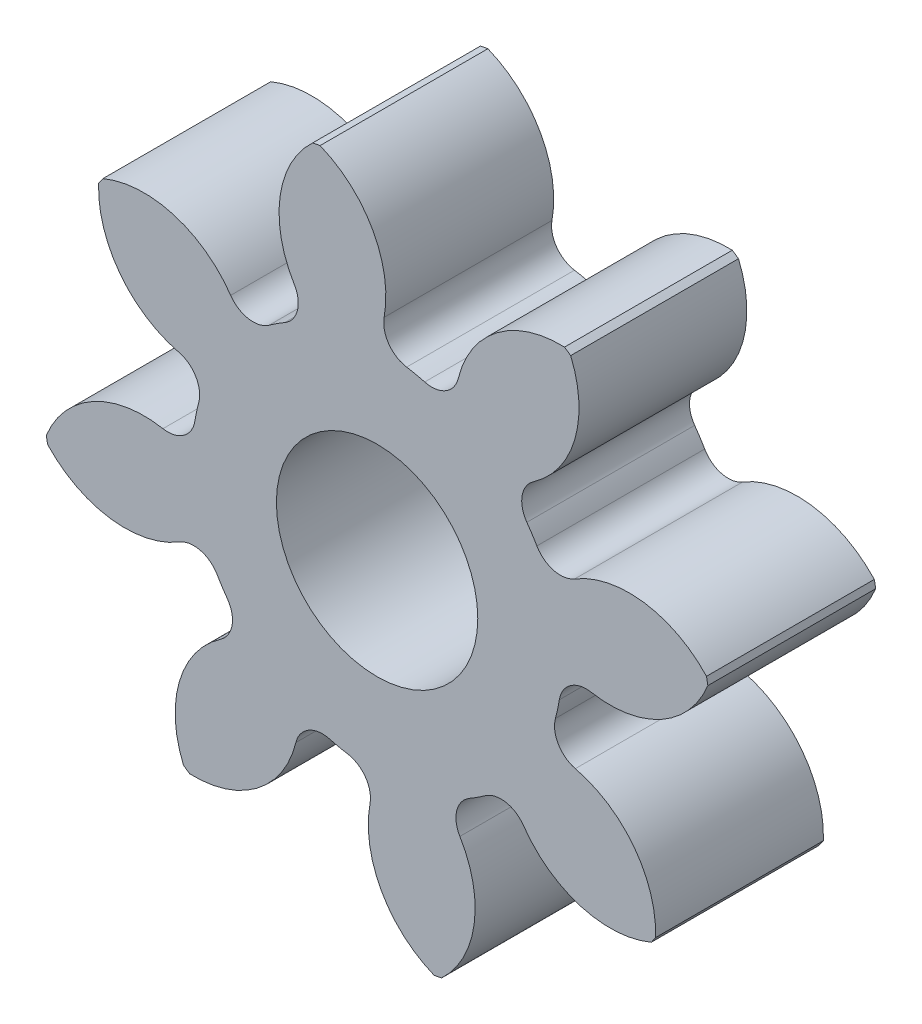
ISO-10303-21;
HEADER;
FILE_DESCRIPTION(('STEP AP214'),'2;1');
FILE_NAME('part.step','',(''),(''),'','','');
FILE_SCHEMA(('AUTOMOTIVE_DESIGN { 1 0 10303 214 1 1 1 1 }'));
ENDSEC;
DATA;
#1=APPLICATION_CONTEXT('core data for automotive mechanical design processes');
#2=APPLICATION_PROTOCOL_DEFINITION('international standard','automotive_design',2000,#1);
#3=PRODUCT_CONTEXT('',#1,'mechanical');
#4=PRODUCT('Part','Part','',(#3));
#5=PRODUCT_RELATED_PRODUCT_CATEGORY('part','',(#4));
#6=PRODUCT_DEFINITION_FORMATION('','',#4);
#7=PRODUCT_DEFINITION_CONTEXT('part definition',#1,'design');
#8=PRODUCT_DEFINITION('design','',#6,#7);
#9=PRODUCT_DEFINITION_SHAPE('','',#8);
#10=(LENGTH_UNIT() NAMED_UNIT(*) SI_UNIT(.MILLI.,.METRE.));
#11=(NAMED_UNIT(*) PLANE_ANGLE_UNIT() SI_UNIT($,.RADIAN.));
#12=(NAMED_UNIT(*) SI_UNIT($,.STERADIAN.) SOLID_ANGLE_UNIT());
#13=UNCERTAINTY_MEASURE_WITH_UNIT(LENGTH_MEASURE(1.E-05),#10,'distance_accuracy_value','');
#14=(GEOMETRIC_REPRESENTATION_CONTEXT(3) GLOBAL_UNCERTAINTY_ASSIGNED_CONTEXT((#13)) GLOBAL_UNIT_ASSIGNED_CONTEXT((#10,
#11,#12)) REPRESENTATION_CONTEXT('',''));
#15=CARTESIAN_POINT('',(0.,0.,0.));
#16=DIRECTION('',(0.,0.,1.));
#17=DIRECTION('',(1.,0.,0.));
#18=AXIS2_PLACEMENT_3D('',#15,#16,#17);
#19=CARTESIAN_POINT('',(0.,0.,127.));
#20=DIRECTION('',(0.,0.,-1.));
#21=DIRECTION('',(-1.,0.,0.));
#22=AXIS2_PLACEMENT_3D('',#19,#20,#21);
#23=CYLINDRICAL_SURFACE('',#22,254.);
#24=DIRECTION('',(0.,0.,-1.));
#25=VECTOR('',#24,1.);
#26=CARTESIAN_POINT('',(48.7339269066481,-249.280974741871,63.5));
#27=LINE('',#26,#25);
#28=CARTESIAN_POINT('',(48.7339269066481,-249.280974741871,127.));
#29=VERTEX_POINT('',#28);
#30=CARTESIAN_POINT('',(48.7339269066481,-249.280974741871,0.));
#31=VERTEX_POINT('',#30);
#32=EDGE_CURVE('E598',#29,#31,#27,.T.);
#33=ORIENTED_EDGE('',*,*,#32,.F.);
#34=CARTESIAN_POINT('',(0.,0.,127.));
#35=DIRECTION('',(0.,0.,1.));
#36=DIRECTION('',(1.,0.,0.));
#37=AXIS2_PLACEMENT_3D('',#34,#35,#36);
#38=CIRCLE('',#37,254.);
#39=CARTESIAN_POINT('',(43.1396847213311,-250.309743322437,127.));
#40=VERTEX_POINT('',#39);
#41=EDGE_CURVE('E674',#40,#29,#38,.T.);
#42=ORIENTED_EDGE('',*,*,#41,.F.);
#43=DIRECTION('',(0.,0.,-1.));
#44=VECTOR('',#43,1.);
#45=CARTESIAN_POINT('',(43.1396847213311,-250.309743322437,63.5));
#46=LINE('',#45,#44);
#47=CARTESIAN_POINT('',(43.1396847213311,-250.309743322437,0.));
#48=VERTEX_POINT('',#47);
#49=EDGE_CURVE('E594',#48,#40,#46,.F.);
#50=ORIENTED_EDGE('',*,*,#49,.F.);
#51=CARTESIAN_POINT('',(0.,0.,0.));
#52=DIRECTION('',(0.,0.,1.));
#53=DIRECTION('',(1.,0.,0.));
#54=AXIS2_PLACEMENT_3D('',#51,#52,#53);
#55=CIRCLE('',#54,254.);
#56=EDGE_CURVE('E673',#48,#31,#55,.T.);
#57=ORIENTED_EDGE('',*,*,#56,.T.);
#58=EDGE_LOOP('',(#33,#42,#50,#57));
#59=FACE_BOUND('',#58,.T.);
#60=ADVANCED_FACE('F33',(#59),#23,.T.);
#61=DIRECTION('',(0.,0.,-1.));
#62=VECTOR('',#61,1.);
#63=CARTESIAN_POINT('',(207.500080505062,-146.491353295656,63.5));
#64=LINE('',#63,#62);
#65=CARTESIAN_POINT('',(207.500080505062,-146.491353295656,0.));
#66=VERTEX_POINT('',#65);
#67=CARTESIAN_POINT('',(207.500080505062,-146.491353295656,127.));
#68=VERTEX_POINT('',#67);
#69=EDGE_CURVE('E596',#66,#68,#64,.F.);
#70=ORIENTED_EDGE('',*,*,#69,.F.);
#71=CARTESIAN_POINT('',(210.72835785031,-141.808177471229,0.));
#72=VERTEX_POINT('',#71);
#73=EDGE_CURVE('E638',#66,#72,#55,.T.);
#74=ORIENTED_EDGE('',*,*,#73,.T.);
#75=DIRECTION('',(0.,0.,-1.));
#76=VECTOR('',#75,1.);
#77=CARTESIAN_POINT('',(210.72835785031,-141.808177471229,63.5));
#78=LINE('',#77,#76);
#79=CARTESIAN_POINT('',(210.72835785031,-141.808177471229,127.));
#80=VERTEX_POINT('',#79);
#81=EDGE_CURVE('E635',#80,#72,#78,.T.);
#82=ORIENTED_EDGE('',*,*,#81,.F.);
#83=EDGE_CURVE('E644',#68,#80,#38,.T.);
#84=ORIENTED_EDGE('',*,*,#83,.F.);
#85=EDGE_LOOP('',(#70,#74,#82,#84));
#86=FACE_BOUND('',#85,.T.);
#87=ADVANCED_FACE('F684',(#86),#23,.T.);
#88=DIRECTION('',(0.,0.,-1.));
#89=VECTOR('',#88,1.);
#90=CARTESIAN_POINT('',(-141.80817747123,-210.72835785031,63.5));
#91=LINE('',#90,#89);
#92=CARTESIAN_POINT('',(-141.80817747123,-210.72835785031,127.));
#93=VERTEX_POINT('',#92);
#94=CARTESIAN_POINT('',(-141.80817747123,-210.72835785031,0.));
#95=VERTEX_POINT('',#94);
#96=EDGE_CURVE('E592',#93,#95,#91,.T.);
#97=ORIENTED_EDGE('',*,*,#96,.F.);
#98=CARTESIAN_POINT('',(-146.491353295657,-207.500080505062,127.));
#99=VERTEX_POINT('',#98);
#100=EDGE_CURVE('E700',#99,#93,#38,.T.);
#101=ORIENTED_EDGE('',*,*,#100,.F.);
#102=DIRECTION('',(0.,0.,-1.));
#103=VECTOR('',#102,1.);
#104=CARTESIAN_POINT('',(-146.491353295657,-207.500080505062,63.5));
#105=LINE('',#104,#103);
#106=CARTESIAN_POINT('',(-146.491353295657,-207.500080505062,0.));
#107=VERTEX_POINT('',#106);
#108=EDGE_CURVE('E590',#107,#99,#105,.F.);
#109=ORIENTED_EDGE('',*,*,#108,.F.);
#110=EDGE_CURVE('E677',#107,#95,#55,.T.);
#111=ORIENTED_EDGE('',*,*,#110,.T.);
#112=EDGE_LOOP('',(#97,#101,#109,#111));
#113=FACE_BOUND('',#112,.T.);
#114=ADVANCED_FACE('F835',(#113),#23,.T.);
#115=DIRECTION('',(0.,0.,-1.));
#116=VECTOR('',#115,1.);
#117=CARTESIAN_POINT('',(-249.280974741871,-48.7339269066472,63.5));
#118=LINE('',#117,#116);
#119=CARTESIAN_POINT('',(-249.280974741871,-48.7339269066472,127.));
#120=VERTEX_POINT('',#119);
#121=CARTESIAN_POINT('',(-249.280974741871,-48.7339269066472,0.));
#122=VERTEX_POINT('',#121);
#123=EDGE_CURVE('E588',#120,#122,#118,.T.);
#124=ORIENTED_EDGE('',*,*,#123,.F.);
#125=CARTESIAN_POINT('',(-250.309743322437,-43.1396847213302,127.));
#126=VERTEX_POINT('',#125);
#127=EDGE_CURVE('E703',#126,#120,#38,.T.);
#128=ORIENTED_EDGE('',*,*,#127,.F.);
#129=DIRECTION('',(0.,0.,-1.));
#130=VECTOR('',#129,1.);
#131=CARTESIAN_POINT('',(-250.309743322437,-43.1396847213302,63.5));
#132=LINE('',#131,#130);
#133=CARTESIAN_POINT('',(-250.309743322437,-43.1396847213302,0.));
#134=VERTEX_POINT('',#133);
#135=EDGE_CURVE('E586',#134,#126,#132,.F.);
#136=ORIENTED_EDGE('',*,*,#135,.F.);
#137=EDGE_CURVE('E679',#134,#122,#55,.T.);
#138=ORIENTED_EDGE('',*,*,#137,.T.);
#139=EDGE_LOOP('',(#124,#128,#136,#138));
#140=FACE_BOUND('',#139,.T.);
#141=ADVANCED_FACE('F810',(#140),#23,.T.);
#142=DIRECTION('',(0.,0.,-1.));
#143=VECTOR('',#142,1.);
#144=CARTESIAN_POINT('',(-210.728357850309,141.80817747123,63.5));
#145=LINE('',#144,#143);
#146=CARTESIAN_POINT('',(-210.728357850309,141.80817747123,127.));
#147=VERTEX_POINT('',#146);
#148=CARTESIAN_POINT('',(-210.728357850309,141.80817747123,0.));
#149=VERTEX_POINT('',#148);
#150=EDGE_CURVE('E584',#147,#149,#145,.T.);
#151=ORIENTED_EDGE('',*,*,#150,.F.);
#152=CARTESIAN_POINT('',(-207.500080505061,146.491353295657,127.));
#153=VERTEX_POINT('',#152);
#154=EDGE_CURVE('E708',#153,#147,#38,.T.);
#155=ORIENTED_EDGE('',*,*,#154,.F.);
#156=DIRECTION('',(0.,0.,-1.));
#157=VECTOR('',#156,1.);
#158=CARTESIAN_POINT('',(-207.500080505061,146.491353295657,63.5));
#159=LINE('',#158,#157);
#160=CARTESIAN_POINT('',(-207.500080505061,146.491353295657,0.));
#161=VERTEX_POINT('',#160);
#162=EDGE_CURVE('E582',#161,#153,#159,.F.);
#163=ORIENTED_EDGE('',*,*,#162,.F.);
#164=EDGE_CURVE('E778',#161,#149,#55,.T.);
#165=ORIENTED_EDGE('',*,*,#164,.T.);
#166=EDGE_LOOP('',(#151,#155,#163,#165));
#167=FACE_BOUND('',#166,.T.);
#168=ADVANCED_FACE('F784',(#167),#23,.T.);
#169=DIRECTION('',(0.,0.,-1.));
#170=VECTOR('',#169,1.);
#171=CARTESIAN_POINT('',(-48.7339269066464,249.280974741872,63.5));
#172=LINE('',#171,#170);
#173=CARTESIAN_POINT('',(-48.7339269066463,249.280974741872,127.));
#174=VERTEX_POINT('',#173);
#175=CARTESIAN_POINT('',(-48.7339269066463,249.280974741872,0.));
#176=VERTEX_POINT('',#175);
#177=EDGE_CURVE('E580',#174,#176,#172,.T.);
#178=ORIENTED_EDGE('',*,*,#177,.F.);
#179=CARTESIAN_POINT('',(-43.1396847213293,250.309743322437,127.));
#180=VERTEX_POINT('',#179);
#181=EDGE_CURVE('E713',#180,#174,#38,.T.);
#182=ORIENTED_EDGE('',*,*,#181,.F.);
#183=DIRECTION('',(0.,0.,-1.));
#184=VECTOR('',#183,1.);
#185=CARTESIAN_POINT('',(-43.1396847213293,250.309743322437,63.5));
#186=LINE('',#185,#184);
#187=CARTESIAN_POINT('',(-43.1396847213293,250.309743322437,0.));
#188=VERTEX_POINT('',#187);
#189=EDGE_CURVE('E578',#188,#180,#186,.F.);
#190=ORIENTED_EDGE('',*,*,#189,.F.);
#191=EDGE_CURVE('E751',#188,#176,#55,.T.);
#192=ORIENTED_EDGE('',*,*,#191,.T.);
#193=EDGE_LOOP('',(#178,#182,#190,#192));
#194=FACE_BOUND('',#193,.T.);
#195=ADVANCED_FACE('F757',(#194),#23,.T.);
#196=DIRECTION('',(0.,0.,-1.));
#197=VECTOR('',#196,1.);
#198=CARTESIAN_POINT('',(141.808177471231,210.728357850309,63.5));
#199=LINE('',#198,#197);
#200=CARTESIAN_POINT('',(141.808177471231,210.728357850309,127.));
#201=VERTEX_POINT('',#200);
#202=CARTESIAN_POINT('',(141.808177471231,210.728357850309,0.));
#203=VERTEX_POINT('',#202);
#204=EDGE_CURVE('E576',#201,#203,#199,.T.);
#205=ORIENTED_EDGE('',*,*,#204,.F.);
#206=CARTESIAN_POINT('',(146.491353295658,207.500080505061,127.));
#207=VERTEX_POINT('',#206);
#208=EDGE_CURVE('E643',#207,#201,#38,.T.);
#209=ORIENTED_EDGE('',*,*,#208,.F.);
#210=DIRECTION('',(0.,0.,-1.));
#211=VECTOR('',#210,1.);
#212=CARTESIAN_POINT('',(146.491353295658,207.500080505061,63.5));
#213=LINE('',#212,#211);
#214=CARTESIAN_POINT('',(146.491353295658,207.500080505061,0.));
#215=VERTEX_POINT('',#214);
#216=EDGE_CURVE('E574',#215,#207,#213,.F.);
#217=ORIENTED_EDGE('',*,*,#216,.F.);
#218=EDGE_CURVE('E648',#215,#203,#55,.T.);
#219=ORIENTED_EDGE('',*,*,#218,.T.);
#220=EDGE_LOOP('',(#205,#209,#217,#219));
#221=FACE_BOUND('',#220,.T.);
#222=ADVANCED_FACE('F728',(#221),#23,.T.);
#223=DIRECTION('',(0.,0.,-1.));
#224=VECTOR('',#223,1.);
#225=CARTESIAN_POINT('',(249.280974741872,48.7339269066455,63.5));
#226=LINE('',#225,#224);
#227=CARTESIAN_POINT('',(249.280974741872,48.7339269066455,127.));
#228=VERTEX_POINT('',#227);
#229=CARTESIAN_POINT('',(249.280974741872,48.7339269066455,0.));
#230=VERTEX_POINT('',#229);
#231=EDGE_CURVE('E572',#228,#230,#226,.T.);
#232=ORIENTED_EDGE('',*,*,#231,.F.);
#233=CARTESIAN_POINT('',(250.309743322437,43.1396847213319,127.));
#234=VERTEX_POINT('',#233);
#235=EDGE_CURVE('E639',#234,#228,#38,.T.);
#236=ORIENTED_EDGE('',*,*,#235,.F.);
#237=DIRECTION('',(0.,0.,-1.));
#238=VECTOR('',#237,1.);
#239=CARTESIAN_POINT('',(250.309743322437,43.1396847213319,63.5));
#240=LINE('',#239,#238);
#241=CARTESIAN_POINT('',(250.309743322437,43.1396847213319,0.));
#242=VERTEX_POINT('',#241);
#243=EDGE_CURVE('E633',#242,#234,#240,.F.);
#244=ORIENTED_EDGE('',*,*,#243,.F.);
#245=EDGE_CURVE('E645',#242,#230,#55,.T.);
#246=ORIENTED_EDGE('',*,*,#245,.T.);
#247=EDGE_LOOP('',(#232,#236,#244,#246));
#248=FACE_BOUND('',#247,.T.);
#249=ADVANCED_FACE('F859',(#248),#23,.T.);
#250=CARTESIAN_POINT('',(0.,0.,127.));
#251=DIRECTION('',(0.,0.,1.));
#252=DIRECTION('',(1.,0.,0.));
#253=AXIS2_PLACEMENT_3D('',#250,#251,#252);
#254=PLANE('',#253);
#255=CARTESIAN_POINT('',(0.,0.,127.000000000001));
#256=DIRECTION('',(0.,0.,1.));
#257=DIRECTION('',(1.,0.,0.));
#258=AXIS2_PLACEMENT_3D('',#255,#256,#257);
#259=CIRCLE('',#258,76.2);
#260=CARTESIAN_POINT('',(76.2,0.,127.000000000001));
#261=VERTEX_POINT('',#260);
#262=EDGE_CURVE('E377',#261,#261,#259,.T.);
#263=ORIENTED_EDGE('',*,*,#262,.F.);
#264=EDGE_LOOP('',(#263));
#265=FACE_BOUND('',#264,.T.);
#266=ORIENTED_EDGE('',*,*,#41,.T.);
#267=CARTESIAN_POINT('',(-5.53044208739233,-190.865433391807,127.));
#268=DIRECTION('',(0.,0.,-1.));
#269=DIRECTION('',(0.707106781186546,-0.707106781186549,0.));
#270=AXIS2_PLACEMENT_3D('',#267,#268,#269);
#271=CIRCLE('',#270,79.7307795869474);
#272=CARTESIAN_POINT('',(62.6474981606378,-149.528214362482,127.));
#273=VERTEX_POINT('',#272);
#274=EDGE_CURVE('E551',#273,#29,#271,.T.);
#275=ORIENTED_EDGE('',*,*,#274,.F.);
#276=CARTESIAN_POINT('',(80.3272427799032,-138.808743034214,127.));
#277=DIRECTION('',(0.,0.,1.));
#278=DIRECTION('',(-0.707106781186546,0.707106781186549,0.));
#279=AXIS2_PLACEMENT_3D('',#276,#277,#278);
#280=CIRCLE('',#279,20.6756);
#281=CARTESIAN_POINT('',(69.9714658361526,-120.91353922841,127.));
#282=VERTEX_POINT('',#281);
#283=EDGE_CURVE('E549',#282,#273,#280,.T.);
#284=ORIENTED_EDGE('',*,*,#283,.F.);
#285=CARTESIAN_POINT('',(0.,0.,127.));
#286=DIRECTION('',(0.,0.,-1.));
#287=DIRECTION('',(0.707106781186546,-0.707106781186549,0.));
#288=AXIS2_PLACEMENT_3D('',#285,#286,#287);
#289=CIRCLE('',#288,139.7);
#290=CARTESIAN_POINT('',(81.6844575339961,-113.330222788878,127.));
#291=VERTEX_POINT('',#290);
#292=EDGE_CURVE('E546',#291,#282,#289,.T.);
#293=ORIENTED_EDGE('',*,*,#292,.F.);
#294=CARTESIAN_POINT('',(93.7737572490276,-130.103095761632,127.));
#295=DIRECTION('',(0.,0.,1.));
#296=DIRECTION('',(-0.707106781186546,0.707106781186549,0.));
#297=AXIS2_PLACEMENT_3D('',#294,#295,#296);
#298=CIRCLE('',#297,20.6756);
#299=CARTESIAN_POINT('',(110.790284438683,-118.359236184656,127.));
#300=VERTEX_POINT('',#299);
#301=EDGE_CURVE('E544',#300,#291,#298,.T.);
#302=ORIENTED_EDGE('',*,*,#301,.F.);
#303=CARTESIAN_POINT('',(176.410676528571,-73.0716953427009,127.));
#304=DIRECTION('',(0.,0.,-1.));
#305=DIRECTION('',(-0.707106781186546,0.707106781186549,0.));
#306=AXIS2_PLACEMENT_3D('',#303,#304,#305);
#307=CIRCLE('',#306,79.7307795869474);
#308=EDGE_CURVE('E553',#68,#300,#307,.T.);
#309=ORIENTED_EDGE('',*,*,#308,.F.);
#310=ORIENTED_EDGE('',*,*,#83,.T.);
#311=CARTESIAN_POINT('',(131.051629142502,-138.872855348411,127.));
#312=DIRECTION('',(0.,0.,-1.));
#313=DIRECTION('',(1.,0.,0.));
#314=AXIS2_PLACEMENT_3D('',#311,#312,#313);
#315=CIRCLE('',#314,79.7307795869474);
#316=CARTESIAN_POINT('',(150.030885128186,-61.4339435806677,127.));
#317=VERTEX_POINT('',#316);
#318=EDGE_CURVE('E608',#317,#80,#315,.T.);
#319=ORIENTED_EDGE('',*,*,#318,.F.);
#320=CARTESIAN_POINT('',(154.952541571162,-41.3526654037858,127.));
#321=DIRECTION('',(0.,0.,1.));
#322=DIRECTION('',(-1.,0.,0.));
#323=AXIS2_PLACEMENT_3D('',#320,#321,#322);
#324=CIRCLE('',#323,20.6756);
#325=CARTESIAN_POINT('',(134.97608150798,-36.0214855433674,127.));
#326=VERTEX_POINT('',#325);
#327=EDGE_CURVE('E606',#326,#317,#324,.T.);
#328=ORIENTED_EDGE('',*,*,#327,.F.);
#329=CARTESIAN_POINT('',(0.,0.,127.));
#330=DIRECTION('',(0.,0.,-1.));
#331=DIRECTION('',(1.,0.,0.));
#332=AXIS2_PLACEMENT_3D('',#329,#330,#331);
#333=CIRCLE('',#332,139.7);
#334=CARTESIAN_POINT('',(137.896202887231,-22.3769352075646,127.));
#335=VERTEX_POINT('',#334);
#336=EDGE_CURVE('E603',#335,#326,#333,.T.);
#337=ORIENTED_EDGE('',*,*,#336,.F.);
#338=CARTESIAN_POINT('',(158.304840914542,-25.688721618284,127.));
#339=DIRECTION('',(0.,0.,1.));
#340=DIRECTION('',(-1.,0.,0.));
#341=AXIS2_PLACEMENT_3D('',#338,#339,#340);
#342=CIRCLE('',#341,20.6756);
#343=CARTESIAN_POINT('',(162.03317993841,-5.35205710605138,127.));
#344=VERTEX_POINT('',#343);
#345=EDGE_CURVE('E601',#344,#335,#342,.T.);
#346=ORIENTED_EDGE('',*,*,#345,.F.);
#347=CARTESIAN_POINT('',(176.41067693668,73.0716943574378,127.));
#348=DIRECTION('',(0.,0.,-1.));
#349=DIRECTION('',(-1.,0.,0.));
#350=AXIS2_PLACEMENT_3D('',#347,#348,#349);
#351=CIRCLE('',#350,79.7307795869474);
#352=EDGE_CURVE('E611',#234,#344,#351,.T.);
#353=ORIENTED_EDGE('',*,*,#352,.F.);
#354=ORIENTED_EDGE('',*,*,#235,.T.);
#355=CARTESIAN_POINT('',(190.865433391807,-5.53044208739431,127.));
#356=DIRECTION('',(0.,0.,-1.));
#357=DIRECTION('',(0.707106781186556,0.707106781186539,0.));
#358=AXIS2_PLACEMENT_3D('',#355,#356,#357);
#359=CIRCLE('',#358,79.7307795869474);
#360=CARTESIAN_POINT('',(149.528214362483,62.6474981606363,127.));
#361=VERTEX_POINT('',#360);
#362=EDGE_CURVE('E368',#361,#228,#359,.T.);
#363=ORIENTED_EDGE('',*,*,#362,.F.);
#364=CARTESIAN_POINT('',(138.808743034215,80.3272427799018,127.));
#365=DIRECTION('',(0.,0.,1.));
#366=DIRECTION('',(-0.707106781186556,-0.707106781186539,0.));
#367=AXIS2_PLACEMENT_3D('',#364,#365,#366);
#368=CIRCLE('',#367,20.6756);
#369=CARTESIAN_POINT('',(120.91353922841,69.9714658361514,127.));
#370=VERTEX_POINT('',#369);
#371=EDGE_CURVE('E366',#370,#361,#368,.T.);
#372=ORIENTED_EDGE('',*,*,#371,.F.);
#373=CARTESIAN_POINT('',(0.,0.,127.));
#374=DIRECTION('',(0.,0.,-1.));
#375=DIRECTION('',(0.707106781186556,0.707106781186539,0.));
#376=AXIS2_PLACEMENT_3D('',#373,#374,#375);
#377=CIRCLE('',#376,139.7);
#378=CARTESIAN_POINT('',(113.330222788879,81.6844575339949,127.));
#379=VERTEX_POINT('',#378);
#380=EDGE_CURVE('E351',#379,#370,#377,.T.);
#381=ORIENTED_EDGE('',*,*,#380,.F.);
#382=CARTESIAN_POINT('',(130.103095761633,93.7737572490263,127.));
#383=DIRECTION('',(0.,0.,1.));
#384=DIRECTION('',(-0.707106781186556,-0.707106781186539,0.));
#385=AXIS2_PLACEMENT_3D('',#382,#383,#384);
#386=CIRCLE('',#385,20.6756);
#387=CARTESIAN_POINT('',(118.359236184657,110.790284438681,127.));
#388=VERTEX_POINT('',#387);
#389=EDGE_CURVE('E341',#388,#379,#386,.T.);
#390=ORIENTED_EDGE('',*,*,#389,.F.);
#391=CARTESIAN_POINT('',(73.0716953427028,176.41067652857,127.));
#392=DIRECTION('',(0.,0.,-1.));
#393=DIRECTION('',(-0.707106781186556,-0.707106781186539,0.));
#394=AXIS2_PLACEMENT_3D('',#391,#392,#393);
#395=CIRCLE('',#394,79.7307795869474);
#396=EDGE_CURVE('E373',#207,#388,#395,.T.);
#397=ORIENTED_EDGE('',*,*,#396,.F.);
#398=ORIENTED_EDGE('',*,*,#208,.T.);
#399=CARTESIAN_POINT('',(138.872855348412,131.051629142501,127.));
#400=DIRECTION('',(0.,0.,-1.));
#401=DIRECTION('',(0.,1.,0.));
#402=AXIS2_PLACEMENT_3D('',#399,#400,#401);
#403=CIRCLE('',#402,79.7307795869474);
#404=CARTESIAN_POINT('',(61.4339435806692,150.030885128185,127.));
#405=VERTEX_POINT('',#404);
#406=EDGE_CURVE('E395',#405,#201,#403,.T.);
#407=ORIENTED_EDGE('',*,*,#406,.F.);
#408=CARTESIAN_POINT('',(41.3526654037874,154.952541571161,127.));
#409=DIRECTION('',(0.,0.,1.));
#410=DIRECTION('',(0.,-1.,0.));
#411=AXIS2_PLACEMENT_3D('',#408,#409,#410);
#412=CIRCLE('',#411,20.6756);
#413=CARTESIAN_POINT('',(36.0214855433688,134.97608150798,127.));
#414=VERTEX_POINT('',#413);
#415=EDGE_CURVE('E393',#414,#405,#412,.T.);
#416=ORIENTED_EDGE('',*,*,#415,.F.);
#417=CARTESIAN_POINT('',(0.,0.,127.));
#418=DIRECTION('',(0.,0.,-1.));
#419=DIRECTION('',(0.,1.,0.));
#420=AXIS2_PLACEMENT_3D('',#417,#418,#419);
#421=CIRCLE('',#420,139.7);
#422=CARTESIAN_POINT('',(22.376935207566,137.896202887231,127.));
#423=VERTEX_POINT('',#422);
#424=EDGE_CURVE('E390',#423,#414,#421,.T.);
#425=ORIENTED_EDGE('',*,*,#424,.F.);
#426=CARTESIAN_POINT('',(25.6887216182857,158.304840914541,127.));
#427=DIRECTION('',(0.,0.,1.));
#428=DIRECTION('',(0.,-1.,0.));
#429=AXIS2_PLACEMENT_3D('',#426,#427,#428);
#430=CIRCLE('',#429,20.6756);
#431=CARTESIAN_POINT('',(5.35205710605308,162.03317993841,127.));
#432=VERTEX_POINT('',#431);
#433=EDGE_CURVE('E388',#432,#423,#430,.T.);
#434=ORIENTED_EDGE('',*,*,#433,.F.);
#435=CARTESIAN_POINT('',(-73.071694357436,176.410676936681,127.));
#436=DIRECTION('',(0.,0.,-1.));
#437=DIRECTION('',(0.,-1.,0.));
#438=AXIS2_PLACEMENT_3D('',#435,#436,#437);
#439=CIRCLE('',#438,79.7307795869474);
#440=EDGE_CURVE('E397',#180,#432,#439,.T.);
#441=ORIENTED_EDGE('',*,*,#440,.F.);
#442=ORIENTED_EDGE('',*,*,#181,.T.);
#443=CARTESIAN_POINT('',(5.53044208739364,190.865433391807,127.));
#444=DIRECTION('',(0.,0.,-1.));
#445=DIRECTION('',(-0.707106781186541,0.707106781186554,0.));
#446=AXIS2_PLACEMENT_3D('',#443,#444,#445);
#447=CIRCLE('',#446,79.7307795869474);
#448=CARTESIAN_POINT('',(-62.6474981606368,149.528214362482,127.));
#449=VERTEX_POINT('',#448);
#450=EDGE_CURVE('E427',#449,#174,#447,.T.);
#451=ORIENTED_EDGE('',*,*,#450,.F.);
#452=CARTESIAN_POINT('',(-80.3272427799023,138.808743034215,127.));
#453=DIRECTION('',(0.,0.,1.));
#454=DIRECTION('',(0.707106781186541,-0.707106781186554,0.));
#455=AXIS2_PLACEMENT_3D('',#452,#453,#454);
#456=CIRCLE('',#455,20.6756);
#457=CARTESIAN_POINT('',(-69.9714658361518,120.91353922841,127.));
#458=VERTEX_POINT('',#457);
#459=EDGE_CURVE('E425',#458,#449,#456,.T.);
#460=ORIENTED_EDGE('',*,*,#459,.F.);
#461=CARTESIAN_POINT('',(0.,0.,127.));
#462=DIRECTION('',(0.,0.,-1.));
#463=DIRECTION('',(-0.707106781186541,0.707106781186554,0.));
#464=AXIS2_PLACEMENT_3D('',#461,#462,#463);
#465=CIRCLE('',#464,139.7);
#466=CARTESIAN_POINT('',(-81.6844575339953,113.330222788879,127.));
#467=VERTEX_POINT('',#466);
#468=EDGE_CURVE('E422',#467,#458,#465,.T.);
#469=ORIENTED_EDGE('',*,*,#468,.F.);
#470=CARTESIAN_POINT('',(-93.7737572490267,130.103095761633,127.));
#471=DIRECTION('',(0.,0.,1.));
#472=DIRECTION('',(0.707106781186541,-0.707106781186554,0.));
#473=AXIS2_PLACEMENT_3D('',#470,#471,#472);
#474=CIRCLE('',#473,20.6756);
#475=CARTESIAN_POINT('',(-110.790284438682,118.359236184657,127.));
#476=VERTEX_POINT('',#475);
#477=EDGE_CURVE('E420',#476,#467,#474,.T.);
#478=ORIENTED_EDGE('',*,*,#477,.F.);
#479=CARTESIAN_POINT('',(-176.41067652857,73.0716953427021,127.));
#480=DIRECTION('',(0.,0.,-1.));
#481=DIRECTION('',(0.707106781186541,-0.707106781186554,0.));
#482=AXIS2_PLACEMENT_3D('',#479,#480,#481);
#483=CIRCLE('',#482,79.7307795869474);
#484=EDGE_CURVE('E429',#153,#476,#483,.T.);
#485=ORIENTED_EDGE('',*,*,#484,.F.);
#486=ORIENTED_EDGE('',*,*,#154,.T.);
#487=CARTESIAN_POINT('',(-131.051629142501,138.872855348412,127.));
#488=DIRECTION('',(0.,0.,-1.));
#489=DIRECTION('',(-1.,0.,0.));
#490=AXIS2_PLACEMENT_3D('',#487,#488,#489);
#491=CIRCLE('',#490,79.7307795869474);
#492=CARTESIAN_POINT('',(-150.030885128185,61.4339435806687,127.));
#493=VERTEX_POINT('',#492);
#494=EDGE_CURVE('E459',#493,#147,#491,.T.);
#495=ORIENTED_EDGE('',*,*,#494,.F.);
#496=CARTESIAN_POINT('',(-154.952541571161,41.3526654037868,127.));
#497=DIRECTION('',(0.,0.,1.));
#498=DIRECTION('',(1.,0.,0.));
#499=AXIS2_PLACEMENT_3D('',#496,#497,#498);
#500=CIRCLE('',#499,20.6756);
#501=CARTESIAN_POINT('',(-134.97608150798,36.0214855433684,127.));
#502=VERTEX_POINT('',#501);
#503=EDGE_CURVE('E457',#502,#493,#500,.T.);
#504=ORIENTED_EDGE('',*,*,#503,.F.);
#505=CARTESIAN_POINT('',(0.,0.,127.));
#506=DIRECTION('',(0.,0.,-1.));
#507=DIRECTION('',(-1.,0.,0.));
#508=AXIS2_PLACEMENT_3D('',#505,#506,#507);
#509=CIRCLE('',#508,139.7);
#510=CARTESIAN_POINT('',(-137.896202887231,22.3769352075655,127.));
#511=VERTEX_POINT('',#510);
#512=EDGE_CURVE('E454',#511,#502,#509,.T.);
#513=ORIENTED_EDGE('',*,*,#512,.F.);
#514=CARTESIAN_POINT('',(-158.304840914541,25.6887216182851,127.));
#515=DIRECTION('',(0.,0.,1.));
#516=DIRECTION('',(1.,0.,0.));
#517=AXIS2_PLACEMENT_3D('',#514,#515,#516);
#518=CIRCLE('',#517,20.6756);
#519=CARTESIAN_POINT('',(-162.03317993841,5.35205710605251,127.));
#520=VERTEX_POINT('',#519);
#521=EDGE_CURVE('E452',#520,#511,#518,.T.);
#522=ORIENTED_EDGE('',*,*,#521,.F.);
#523=CARTESIAN_POINT('',(-176.41067693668,-73.0716943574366,127.));
#524=DIRECTION('',(0.,0.,-1.));
#525=DIRECTION('',(1.,0.,0.));
#526=AXIS2_PLACEMENT_3D('',#523,#524,#525);
#527=CIRCLE('',#526,79.7307795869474);
#528=EDGE_CURVE('E461',#126,#520,#527,.T.);
#529=ORIENTED_EDGE('',*,*,#528,.F.);
#530=ORIENTED_EDGE('',*,*,#127,.T.);
#531=CARTESIAN_POINT('',(-190.865433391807,5.53044208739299,127.));
#532=DIRECTION('',(0.,0.,-1.));
#533=DIRECTION('',(-0.707106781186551,-0.707106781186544,0.));
#534=AXIS2_PLACEMENT_3D('',#531,#532,#533);
#535=CIRCLE('',#534,79.7307795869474);
#536=CARTESIAN_POINT('',(-149.528214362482,-62.6474981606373,127.));
#537=VERTEX_POINT('',#536);
#538=EDGE_CURVE('E491',#537,#120,#535,.T.);
#539=ORIENTED_EDGE('',*,*,#538,.F.);
#540=CARTESIAN_POINT('',(-138.808743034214,-80.3272427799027,127.));
#541=DIRECTION('',(0.,0.,1.));
#542=DIRECTION('',(0.707106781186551,0.707106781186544,0.));
#543=AXIS2_PLACEMENT_3D('',#540,#541,#542);
#544=CIRCLE('',#543,20.6756);
#545=CARTESIAN_POINT('',(-120.91353922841,-69.9714658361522,127.));
#546=VERTEX_POINT('',#545);
#547=EDGE_CURVE('E489',#546,#537,#544,.T.);
#548=ORIENTED_EDGE('',*,*,#547,.F.);
#549=CARTESIAN_POINT('',(0.,0.,127.));
#550=DIRECTION('',(0.,0.,-1.));
#551=DIRECTION('',(-0.707106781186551,-0.707106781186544,0.));
#552=AXIS2_PLACEMENT_3D('',#549,#550,#551);
#553=CIRCLE('',#552,139.7);
#554=CARTESIAN_POINT('',(-113.330222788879,-81.6844575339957,127.));
#555=VERTEX_POINT('',#554);
#556=EDGE_CURVE('E486',#555,#546,#553,.T.);
#557=ORIENTED_EDGE('',*,*,#556,.F.);
#558=CARTESIAN_POINT('',(-130.103095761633,-93.7737572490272,127.));
#559=DIRECTION('',(0.,0.,1.));
#560=DIRECTION('',(0.707106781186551,0.707106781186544,0.));
#561=AXIS2_PLACEMENT_3D('',#558,#559,#560);
#562=CIRCLE('',#561,20.6756);
#563=CARTESIAN_POINT('',(-118.359236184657,-110.790284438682,127.));
#564=VERTEX_POINT('',#563);
#565=EDGE_CURVE('E484',#564,#555,#562,.T.);
#566=ORIENTED_EDGE('',*,*,#565,.F.);
#567=CARTESIAN_POINT('',(-73.0716953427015,-176.41067652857,127.));
#568=DIRECTION('',(0.,0.,-1.));
#569=DIRECTION('',(0.707106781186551,0.707106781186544,0.));
#570=AXIS2_PLACEMENT_3D('',#567,#568,#569);
#571=CIRCLE('',#570,79.7307795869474);
#572=EDGE_CURVE('E493',#99,#564,#571,.T.);
#573=ORIENTED_EDGE('',*,*,#572,.F.);
#574=ORIENTED_EDGE('',*,*,#100,.T.);
#575=CARTESIAN_POINT('',(-138.872855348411,-131.051629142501,127.));
#576=DIRECTION('',(0.,0.,-1.));
#577=DIRECTION('',(0.,-1.,0.));
#578=AXIS2_PLACEMENT_3D('',#575,#576,#577);
#579=CIRCLE('',#578,79.7307795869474);
#580=CARTESIAN_POINT('',(-61.4339435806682,-150.030885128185,127.));
#581=VERTEX_POINT('',#580);
#582=EDGE_CURVE('E522',#581,#93,#579,.T.);
#583=ORIENTED_EDGE('',*,*,#582,.F.);
#584=CARTESIAN_POINT('',(-41.3526654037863,-154.952541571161,127.));
#585=DIRECTION('',(0.,0.,1.));
#586=DIRECTION('',(0.,1.,0.));
#587=AXIS2_PLACEMENT_3D('',#584,#585,#586);
#588=CIRCLE('',#587,20.6756);
#589=CARTESIAN_POINT('',(-36.0214855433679,-134.97608150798,127.));
#590=VERTEX_POINT('',#589);
#591=EDGE_CURVE('E520',#590,#581,#588,.T.);
#592=ORIENTED_EDGE('',*,*,#591,.F.);
#593=CARTESIAN_POINT('',(0.,0.,127.));
#594=DIRECTION('',(0.,0.,-1.));
#595=DIRECTION('',(0.,-1.,0.));
#596=AXIS2_PLACEMENT_3D('',#593,#594,#595);
#597=CIRCLE('',#596,139.7);
#598=CARTESIAN_POINT('',(-22.376935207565,-137.896202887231,127.));
#599=VERTEX_POINT('',#598);
#600=EDGE_CURVE('E518',#599,#590,#597,.T.);
#601=ORIENTED_EDGE('',*,*,#600,.F.);
#602=CARTESIAN_POINT('',(-25.6887216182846,-158.304840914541,127.));
#603=DIRECTION('',(0.,0.,1.));
#604=DIRECTION('',(0.,1.,0.));
#605=AXIS2_PLACEMENT_3D('',#602,#603,#604);
#606=CIRCLE('',#605,20.6756);
#607=CARTESIAN_POINT('',(-5.35205710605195,-162.03317993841,127.));
#608=VERTEX_POINT('',#607);
#609=EDGE_CURVE('E516',#608,#599,#606,.T.);
#610=ORIENTED_EDGE('',*,*,#609,.F.);
#611=CARTESIAN_POINT('',(73.0716943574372,-176.41067693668,127.));
#612=DIRECTION('',(0.,0.,-1.));
#613=DIRECTION('',(0.,1.,0.));
#614=AXIS2_PLACEMENT_3D('',#611,#612,#613);
#615=CIRCLE('',#614,79.7307795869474);
#616=EDGE_CURVE('E524',#40,#608,#615,.T.);
#617=ORIENTED_EDGE('',*,*,#616,.F.);
#618=EDGE_LOOP('',(#266,#275,#284,#293,#302,#309,#310,#319,#328,#337,#346,#353,#354,#363,#372,
#381,#390,#397,#398,#407,#416,#425,#434,#441,#442,#451,#460,#469,#478,#485,#486,#495,#504,#513,
#522,#529,#530,#539,#548,#557,#566,#573,#574,#583,#592,#601,#610,#617));
#619=FACE_BOUND('',#618,.T.);
#620=ADVANCED_FACE('F364',(#265,#619),#254,.T.);
#621=CARTESIAN_POINT('',(0.,0.,0.));
#622=DIRECTION('',(0.,0.,1.));
#623=DIRECTION('',(1.,0.,0.));
#624=AXIS2_PLACEMENT_3D('',#621,#622,#623);
#625=PLANE('',#624);
#626=CARTESIAN_POINT('',(0.,0.,0.));
#627=DIRECTION('',(0.,0.,1.));
#628=DIRECTION('',(1.,0.,0.));
#629=AXIS2_PLACEMENT_3D('',#626,#627,#628);
#630=CIRCLE('',#629,76.2);
#631=CARTESIAN_POINT('',(76.2,0.,-1.77635683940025E-12));
#632=VERTEX_POINT('',#631);
#633=EDGE_CURVE('E36',#632,#632,#630,.T.);
#634=ORIENTED_EDGE('',*,*,#633,.T.);
#635=EDGE_LOOP('',(#634));
#636=FACE_BOUND('',#635,.T.);
#637=CARTESIAN_POINT('',(-5.53044208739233,-190.865433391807,0.));
#638=DIRECTION('',(0.,0.,-1.));
#639=DIRECTION('',(0.707106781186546,-0.707106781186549,0.));
#640=AXIS2_PLACEMENT_3D('',#637,#638,#639);
#641=CIRCLE('',#640,79.7307795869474);
#642=CARTESIAN_POINT('',(62.6474981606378,-149.528214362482,0.));
#643=VERTEX_POINT('',#642);
#644=EDGE_CURVE('E547',#643,#31,#641,.T.);
#645=ORIENTED_EDGE('',*,*,#644,.T.);
#646=ORIENTED_EDGE('',*,*,#56,.F.);
#647=CARTESIAN_POINT('',(73.0716943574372,-176.41067693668,0.));
#648=DIRECTION('',(0.,0.,1.));
#649=DIRECTION('',(1.,0.,0.));
#650=AXIS2_PLACEMENT_3D('',#647,#648,#649);
#651=CIRCLE('',#650,79.7307795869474);
#652=CARTESIAN_POINT('',(-5.35205710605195,-162.03317993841,0.));
#653=VERTEX_POINT('',#652);
#654=EDGE_CURVE('E41',#653,#48,#651,.T.);
#655=ORIENTED_EDGE('',*,*,#654,.F.);
#656=CARTESIAN_POINT('',(-25.6887216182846,-158.304840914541,0.));
#657=DIRECTION('',(0.,0.,1.));
#658=DIRECTION('',(0.,1.,0.));
#659=AXIS2_PLACEMENT_3D('',#656,#657,#658);
#660=CIRCLE('',#659,20.6756);
#661=CARTESIAN_POINT('',(-22.376935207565,-137.896202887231,0.));
#662=VERTEX_POINT('',#661);
#663=EDGE_CURVE('E515',#653,#662,#660,.T.);
#664=ORIENTED_EDGE('',*,*,#663,.T.);
#665=CARTESIAN_POINT('',(0.,0.,0.));
#666=DIRECTION('',(0.,0.,-1.));
#667=DIRECTION('',(0.,-1.,0.));
#668=AXIS2_PLACEMENT_3D('',#665,#666,#667);
#669=CIRCLE('',#668,139.7);
#670=CARTESIAN_POINT('',(-36.0214855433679,-134.97608150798,0.));
#671=VERTEX_POINT('',#670);
#672=EDGE_CURVE('E529',#662,#671,#669,.T.);
#673=ORIENTED_EDGE('',*,*,#672,.T.);
#674=CARTESIAN_POINT('',(-41.3526654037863,-154.952541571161,0.));
#675=DIRECTION('',(0.,0.,1.));
#676=DIRECTION('',(0.,1.,0.));
#677=AXIS2_PLACEMENT_3D('',#674,#675,#676);
#678=CIRCLE('',#677,20.6756);
#679=CARTESIAN_POINT('',(-61.4339435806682,-150.030885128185,0.));
#680=VERTEX_POINT('',#679);
#681=EDGE_CURVE('E532',#671,#680,#678,.T.);
#682=ORIENTED_EDGE('',*,*,#681,.T.);
#683=CARTESIAN_POINT('',(-138.872855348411,-131.051629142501,0.));
#684=DIRECTION('',(0.,0.,-1.));
#685=DIRECTION('',(0.,-1.,0.));
#686=AXIS2_PLACEMENT_3D('',#683,#684,#685);
#687=CIRCLE('',#686,79.7307795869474);
#688=EDGE_CURVE('E56',#680,#95,#687,.T.);
#689=ORIENTED_EDGE('',*,*,#688,.T.);
#690=ORIENTED_EDGE('',*,*,#110,.F.);
#691=CARTESIAN_POINT('',(-73.0716953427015,-176.41067652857,0.));
#692=DIRECTION('',(0.,0.,1.));
#693=DIRECTION('',(1.,0.,0.));
#694=AXIS2_PLACEMENT_3D('',#691,#692,#693);
#695=CIRCLE('',#694,79.7307795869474);
#696=CARTESIAN_POINT('',(-118.359236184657,-110.790284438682,0.));
#697=VERTEX_POINT('',#696);
#698=EDGE_CURVE('E658',#697,#107,#695,.T.);
#699=ORIENTED_EDGE('',*,*,#698,.F.);
#700=CARTESIAN_POINT('',(-130.103095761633,-93.7737572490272,0.));
#701=DIRECTION('',(0.,0.,1.));
#702=DIRECTION('',(0.707106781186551,0.707106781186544,0.));
#703=AXIS2_PLACEMENT_3D('',#700,#701,#702);
#704=CIRCLE('',#703,20.6756);
#705=CARTESIAN_POINT('',(-113.330222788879,-81.6844575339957,0.));
#706=VERTEX_POINT('',#705);
#707=EDGE_CURVE('E483',#697,#706,#704,.T.);
#708=ORIENTED_EDGE('',*,*,#707,.T.);
#709=CARTESIAN_POINT('',(0.,0.,0.));
#710=DIRECTION('',(0.,0.,-1.));
#711=DIRECTION('',(-0.707106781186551,-0.707106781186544,0.));
#712=AXIS2_PLACEMENT_3D('',#709,#710,#711);
#713=CIRCLE('',#712,139.7);
#714=CARTESIAN_POINT('',(-120.91353922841,-69.9714658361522,0.));
#715=VERTEX_POINT('',#714);
#716=EDGE_CURVE('E498',#706,#715,#713,.T.);
#717=ORIENTED_EDGE('',*,*,#716,.T.);
#718=CARTESIAN_POINT('',(-138.808743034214,-80.3272427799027,0.));
#719=DIRECTION('',(0.,0.,1.));
#720=DIRECTION('',(0.707106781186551,0.707106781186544,0.));
#721=AXIS2_PLACEMENT_3D('',#718,#719,#720);
#722=CIRCLE('',#721,20.6756);
#723=CARTESIAN_POINT('',(-149.528214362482,-62.6474981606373,0.));
#724=VERTEX_POINT('',#723);
#725=EDGE_CURVE('E501',#715,#724,#722,.T.);
#726=ORIENTED_EDGE('',*,*,#725,.T.);
#727=CARTESIAN_POINT('',(-190.865433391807,5.53044208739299,0.));
#728=DIRECTION('',(0.,0.,-1.));
#729=DIRECTION('',(-0.707106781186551,-0.707106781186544,0.));
#730=AXIS2_PLACEMENT_3D('',#727,#728,#729);
#731=CIRCLE('',#730,79.7307795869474);
#732=EDGE_CURVE('E487',#724,#122,#731,.T.);
#733=ORIENTED_EDGE('',*,*,#732,.T.);
#734=ORIENTED_EDGE('',*,*,#137,.F.);
#735=CARTESIAN_POINT('',(-176.41067693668,-73.0716943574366,0.));
#736=DIRECTION('',(0.,0.,1.));
#737=DIRECTION('',(1.,0.,0.));
#738=AXIS2_PLACEMENT_3D('',#735,#736,#737);
#739=CIRCLE('',#738,79.7307795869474);
#740=CARTESIAN_POINT('',(-162.03317993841,5.35205710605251,0.));
#741=VERTEX_POINT('',#740);
#742=EDGE_CURVE('E656',#741,#134,#739,.T.);
#743=ORIENTED_EDGE('',*,*,#742,.F.);
#744=CARTESIAN_POINT('',(-158.304840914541,25.6887216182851,0.));
#745=DIRECTION('',(0.,0.,1.));
#746=DIRECTION('',(1.,0.,0.));
#747=AXIS2_PLACEMENT_3D('',#744,#745,#746);
#748=CIRCLE('',#747,20.6756);
#749=CARTESIAN_POINT('',(-137.896202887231,22.3769352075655,0.));
#750=VERTEX_POINT('',#749);
#751=EDGE_CURVE('E451',#741,#750,#748,.T.);
#752=ORIENTED_EDGE('',*,*,#751,.T.);
#753=CARTESIAN_POINT('',(0.,0.,0.));
#754=DIRECTION('',(0.,0.,-1.));
#755=DIRECTION('',(-1.,0.,0.));
#756=AXIS2_PLACEMENT_3D('',#753,#754,#755);
#757=CIRCLE('',#756,139.7);
#758=CARTESIAN_POINT('',(-134.97608150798,36.0214855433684,0.));
#759=VERTEX_POINT('',#758);
#760=EDGE_CURVE('E466',#750,#759,#757,.T.);
#761=ORIENTED_EDGE('',*,*,#760,.T.);
#762=CARTESIAN_POINT('',(-154.952541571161,41.3526654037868,0.));
#763=DIRECTION('',(0.,0.,1.));
#764=DIRECTION('',(1.,0.,0.));
#765=AXIS2_PLACEMENT_3D('',#762,#763,#764);
#766=CIRCLE('',#765,20.6756);
#767=CARTESIAN_POINT('',(-150.030885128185,61.4339435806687,0.));
#768=VERTEX_POINT('',#767);
#769=EDGE_CURVE('E469',#759,#768,#766,.T.);
#770=ORIENTED_EDGE('',*,*,#769,.T.);
#771=CARTESIAN_POINT('',(-131.051629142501,138.872855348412,0.));
#772=DIRECTION('',(0.,0.,-1.));
#773=DIRECTION('',(-1.,0.,0.));
#774=AXIS2_PLACEMENT_3D('',#771,#772,#773);
#775=CIRCLE('',#774,79.7307795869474);
#776=EDGE_CURVE('E455',#768,#149,#775,.T.);
#777=ORIENTED_EDGE('',*,*,#776,.T.);
#778=ORIENTED_EDGE('',*,*,#164,.F.);
#779=CARTESIAN_POINT('',(-176.41067652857,73.0716953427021,0.));
#780=DIRECTION('',(0.,0.,1.));
#781=DIRECTION('',(1.,0.,0.));
#782=AXIS2_PLACEMENT_3D('',#779,#780,#781);
#783=CIRCLE('',#782,79.7307795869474);
#784=CARTESIAN_POINT('',(-110.790284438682,118.359236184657,0.));
#785=VERTEX_POINT('',#784);
#786=EDGE_CURVE('E654',#785,#161,#783,.T.);
#787=ORIENTED_EDGE('',*,*,#786,.F.);
#788=CARTESIAN_POINT('',(-93.7737572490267,130.103095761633,0.));
#789=DIRECTION('',(0.,0.,1.));
#790=DIRECTION('',(0.707106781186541,-0.707106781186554,0.));
#791=AXIS2_PLACEMENT_3D('',#788,#789,#790);
#792=CIRCLE('',#791,20.6756);
#793=CARTESIAN_POINT('',(-81.6844575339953,113.330222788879,0.));
#794=VERTEX_POINT('',#793);
#795=EDGE_CURVE('E419',#785,#794,#792,.T.);
#796=ORIENTED_EDGE('',*,*,#795,.T.);
#797=CARTESIAN_POINT('',(0.,0.,0.));
#798=DIRECTION('',(0.,0.,-1.));
#799=DIRECTION('',(-0.707106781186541,0.707106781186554,0.));
#800=AXIS2_PLACEMENT_3D('',#797,#798,#799);
#801=CIRCLE('',#800,139.7);
#802=CARTESIAN_POINT('',(-69.9714658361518,120.91353922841,0.));
#803=VERTEX_POINT('',#802);
#804=EDGE_CURVE('E434',#794,#803,#801,.T.);
#805=ORIENTED_EDGE('',*,*,#804,.T.);
#806=CARTESIAN_POINT('',(-80.3272427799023,138.808743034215,0.));
#807=DIRECTION('',(0.,0.,1.));
#808=DIRECTION('',(0.707106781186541,-0.707106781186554,0.));
#809=AXIS2_PLACEMENT_3D('',#806,#807,#808);
#810=CIRCLE('',#809,20.6756);
#811=CARTESIAN_POINT('',(-62.6474981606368,149.528214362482,0.));
#812=VERTEX_POINT('',#811);
#813=EDGE_CURVE('E437',#803,#812,#810,.T.);
#814=ORIENTED_EDGE('',*,*,#813,.T.);
#815=CARTESIAN_POINT('',(5.53044208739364,190.865433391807,0.));
#816=DIRECTION('',(0.,0.,-1.));
#817=DIRECTION('',(-0.707106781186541,0.707106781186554,0.));
#818=AXIS2_PLACEMENT_3D('',#815,#816,#817);
#819=CIRCLE('',#818,79.7307795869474);
#820=EDGE_CURVE('E423',#812,#176,#819,.T.);
#821=ORIENTED_EDGE('',*,*,#820,.T.);
#822=ORIENTED_EDGE('',*,*,#191,.F.);
#823=CARTESIAN_POINT('',(-73.071694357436,176.410676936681,0.));
#824=DIRECTION('',(0.,0.,1.));
#825=DIRECTION('',(1.,0.,0.));
#826=AXIS2_PLACEMENT_3D('',#823,#824,#825);
#827=CIRCLE('',#826,79.7307795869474);
#828=CARTESIAN_POINT('',(5.35205710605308,162.03317993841,0.));
#829=VERTEX_POINT('',#828);
#830=EDGE_CURVE('E652',#829,#188,#827,.T.);
#831=ORIENTED_EDGE('',*,*,#830,.F.);
#832=CARTESIAN_POINT('',(25.6887216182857,158.304840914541,0.));
#833=DIRECTION('',(0.,0.,1.));
#834=DIRECTION('',(0.,-1.,0.));
#835=AXIS2_PLACEMENT_3D('',#832,#833,#834);
#836=CIRCLE('',#835,20.6756);
#837=CARTESIAN_POINT('',(22.376935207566,137.896202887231,0.));
#838=VERTEX_POINT('',#837);
#839=EDGE_CURVE('E359',#829,#838,#836,.T.);
#840=ORIENTED_EDGE('',*,*,#839,.T.);
#841=CARTESIAN_POINT('',(0.,0.,0.));
#842=DIRECTION('',(0.,0.,-1.));
#843=DIRECTION('',(0.,1.,0.));
#844=AXIS2_PLACEMENT_3D('',#841,#842,#843);
#845=CIRCLE('',#844,139.7);
#846=CARTESIAN_POINT('',(36.0214855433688,134.97608150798,0.));
#847=VERTEX_POINT('',#846);
#848=EDGE_CURVE('E402',#838,#847,#845,.T.);
#849=ORIENTED_EDGE('',*,*,#848,.T.);
#850=CARTESIAN_POINT('',(41.3526654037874,154.952541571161,0.));
#851=DIRECTION('',(0.,0.,1.));
#852=DIRECTION('',(0.,-1.,0.));
#853=AXIS2_PLACEMENT_3D('',#850,#851,#852);
#854=CIRCLE('',#853,20.6756);
#855=CARTESIAN_POINT('',(61.4339435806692,150.030885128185,0.));
#856=VERTEX_POINT('',#855);
#857=EDGE_CURVE('E405',#847,#856,#854,.T.);
#858=ORIENTED_EDGE('',*,*,#857,.T.);
#859=CARTESIAN_POINT('',(138.872855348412,131.051629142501,0.));
#860=DIRECTION('',(0.,0.,-1.));
#861=DIRECTION('',(0.,1.,0.));
#862=AXIS2_PLACEMENT_3D('',#859,#860,#861);
#863=CIRCLE('',#862,79.7307795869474);
#864=EDGE_CURVE('E391',#856,#203,#863,.T.);
#865=ORIENTED_EDGE('',*,*,#864,.T.);
#866=ORIENTED_EDGE('',*,*,#218,.F.);
#867=CARTESIAN_POINT('',(73.0716953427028,176.41067652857,0.));
#868=DIRECTION('',(0.,0.,1.));
#869=DIRECTION('',(1.,0.,0.));
#870=AXIS2_PLACEMENT_3D('',#867,#868,#869);
#871=CIRCLE('',#870,79.7307795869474);
#872=CARTESIAN_POINT('',(118.359236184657,110.790284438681,0.));
#873=VERTEX_POINT('',#872);
#874=EDGE_CURVE('E650',#873,#215,#871,.T.);
#875=ORIENTED_EDGE('',*,*,#874,.F.);
#876=CARTESIAN_POINT('',(130.103095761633,93.7737572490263,0.));
#877=DIRECTION('',(0.,0.,1.));
#878=DIRECTION('',(-0.707106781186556,-0.707106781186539,0.));
#879=AXIS2_PLACEMENT_3D('',#876,#877,#878);
#880=CIRCLE('',#879,20.6756);
#881=CARTESIAN_POINT('',(113.330222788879,81.6844575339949,0.));
#882=VERTEX_POINT('',#881);
#883=EDGE_CURVE('E375',#873,#882,#880,.T.);
#884=ORIENTED_EDGE('',*,*,#883,.T.);
#885=CARTESIAN_POINT('',(0.,0.,0.));
#886=DIRECTION('',(0.,0.,-1.));
#887=DIRECTION('',(0.707106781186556,0.707106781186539,0.));
#888=AXIS2_PLACEMENT_3D('',#885,#886,#887);
#889=CIRCLE('',#888,139.7);
#890=CARTESIAN_POINT('',(120.91353922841,69.9714658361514,0.));
#891=VERTEX_POINT('',#890);
#892=EDGE_CURVE('E358',#882,#891,#889,.T.);
#893=ORIENTED_EDGE('',*,*,#892,.T.);
#894=CARTESIAN_POINT('',(138.808743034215,80.3272427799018,0.));
#895=DIRECTION('',(0.,0.,1.));
#896=DIRECTION('',(-0.707106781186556,-0.707106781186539,0.));
#897=AXIS2_PLACEMENT_3D('',#894,#895,#896);
#898=CIRCLE('',#897,20.6756);
#899=CARTESIAN_POINT('',(149.528214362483,62.6474981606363,0.));
#900=VERTEX_POINT('',#899);
#901=EDGE_CURVE('E379',#891,#900,#898,.T.);
#902=ORIENTED_EDGE('',*,*,#901,.T.);
#903=CARTESIAN_POINT('',(190.865433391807,-5.53044208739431,0.));
#904=DIRECTION('',(0.,0.,-1.));
#905=DIRECTION('',(0.707106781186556,0.707106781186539,0.));
#906=AXIS2_PLACEMENT_3D('',#903,#904,#905);
#907=CIRCLE('',#906,79.7307795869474);
#908=EDGE_CURVE('E352',#900,#230,#907,.T.);
#909=ORIENTED_EDGE('',*,*,#908,.T.);
#910=ORIENTED_EDGE('',*,*,#245,.F.);
#911=CARTESIAN_POINT('',(176.41067693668,73.0716943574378,0.));
#912=DIRECTION('',(0.,0.,1.));
#913=DIRECTION('',(1.,0.,0.));
#914=AXIS2_PLACEMENT_3D('',#911,#912,#913);
#915=CIRCLE('',#914,79.7307795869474);
#916=CARTESIAN_POINT('',(162.03317993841,-5.35205710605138,0.));
#917=VERTEX_POINT('',#916);
#918=EDGE_CURVE('E642',#917,#242,#915,.T.);
#919=ORIENTED_EDGE('',*,*,#918,.F.);
#920=CARTESIAN_POINT('',(158.304840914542,-25.688721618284,0.));
#921=DIRECTION('',(0.,0.,1.));
#922=DIRECTION('',(-1.,0.,0.));
#923=AXIS2_PLACEMENT_3D('',#920,#921,#922);
#924=CIRCLE('',#923,20.6756);
#925=CARTESIAN_POINT('',(137.896202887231,-22.3769352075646,0.));
#926=VERTEX_POINT('',#925);
#927=EDGE_CURVE('E600',#917,#926,#924,.T.);
#928=ORIENTED_EDGE('',*,*,#927,.T.);
#929=CARTESIAN_POINT('',(0.,0.,0.));
#930=DIRECTION('',(0.,0.,-1.));
#931=DIRECTION('',(1.,0.,0.));
#932=AXIS2_PLACEMENT_3D('',#929,#930,#931);
#933=CIRCLE('',#932,139.7);
#934=CARTESIAN_POINT('',(134.97608150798,-36.0214855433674,0.));
#935=VERTEX_POINT('',#934);
#936=EDGE_CURVE('E616',#926,#935,#933,.T.);
#937=ORIENTED_EDGE('',*,*,#936,.T.);
#938=CARTESIAN_POINT('',(154.952541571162,-41.3526654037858,0.));
#939=DIRECTION('',(0.,0.,1.));
#940=DIRECTION('',(-1.,0.,0.));
#941=AXIS2_PLACEMENT_3D('',#938,#939,#940);
#942=CIRCLE('',#941,20.6756);
#943=CARTESIAN_POINT('',(150.030885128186,-61.4339435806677,0.));
#944=VERTEX_POINT('',#943);
#945=EDGE_CURVE('E619',#935,#944,#942,.T.);
#946=ORIENTED_EDGE('',*,*,#945,.T.);
#947=CARTESIAN_POINT('',(131.051629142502,-138.872855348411,0.));
#948=DIRECTION('',(0.,0.,-1.));
#949=DIRECTION('',(1.,0.,0.));
#950=AXIS2_PLACEMENT_3D('',#947,#948,#949);
#951=CIRCLE('',#950,79.7307795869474);
#952=EDGE_CURVE('E604',#944,#72,#951,.T.);
#953=ORIENTED_EDGE('',*,*,#952,.T.);
#954=ORIENTED_EDGE('',*,*,#73,.F.);
#955=CARTESIAN_POINT('',(176.410676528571,-73.0716953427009,0.));
#956=DIRECTION('',(0.,0.,1.));
#957=DIRECTION('',(1.,0.,0.));
#958=AXIS2_PLACEMENT_3D('',#955,#956,#957);
#959=CIRCLE('',#958,79.7307795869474);
#960=CARTESIAN_POINT('',(110.790284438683,-118.359236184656,0.));
#961=VERTEX_POINT('',#960);
#962=EDGE_CURVE('E11',#961,#66,#959,.T.);
#963=ORIENTED_EDGE('',*,*,#962,.F.);
#964=CARTESIAN_POINT('',(93.7737572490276,-130.103095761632,0.));
#965=DIRECTION('',(0.,0.,1.));
#966=DIRECTION('',(-0.707106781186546,0.707106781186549,0.));
#967=AXIS2_PLACEMENT_3D('',#964,#965,#966);
#968=CIRCLE('',#967,20.6756);
#969=CARTESIAN_POINT('',(81.6844575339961,-113.330222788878,0.));
#970=VERTEX_POINT('',#969);
#971=EDGE_CURVE('E48',#961,#970,#968,.T.);
#972=ORIENTED_EDGE('',*,*,#971,.T.);
#973=CARTESIAN_POINT('',(0.,0.,0.));
#974=DIRECTION('',(0.,0.,-1.));
#975=DIRECTION('',(0.707106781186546,-0.707106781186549,0.));
#976=AXIS2_PLACEMENT_3D('',#973,#974,#975);
#977=CIRCLE('',#976,139.7);
#978=CARTESIAN_POINT('',(69.9714658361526,-120.91353922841,0.));
#979=VERTEX_POINT('',#978);
#980=EDGE_CURVE('E557',#970,#979,#977,.T.);
#981=ORIENTED_EDGE('',*,*,#980,.T.);
#982=CARTESIAN_POINT('',(80.3272427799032,-138.808743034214,0.));
#983=DIRECTION('',(0.,0.,1.));
#984=DIRECTION('',(-0.707106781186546,0.707106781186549,0.));
#985=AXIS2_PLACEMENT_3D('',#982,#983,#984);
#986=CIRCLE('',#985,20.6756);
#987=EDGE_CURVE('E560',#979,#643,#986,.T.);
#988=ORIENTED_EDGE('',*,*,#987,.T.);
#989=EDGE_LOOP('',(#645,#646,#655,#664,#673,#682,#689,#690,#699,#708,#717,#726,#733,#734,#743,
#752,#761,#770,#777,#778,#787,#796,#805,#814,#821,#822,#831,#840,#849,#858,#865,#866,#875,#884,
#893,#902,#909,#910,#919,#928,#937,#946,#953,#954,#963,#972,#981,#988));
#990=FACE_BOUND('',#989,.T.);
#991=ADVANCED_FACE('F675',(#636,#990),#625,.F.);
#992=CARTESIAN_POINT('',(131.051629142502,-138.872855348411,127.));
#993=DIRECTION('',(0.,0.,-1.));
#994=DIRECTION('',(-1.,0.,0.));
#995=AXIS2_PLACEMENT_3D('',#992,#993,#994);
#996=CYLINDRICAL_SURFACE('',#995,79.7307795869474);
#997=ORIENTED_EDGE('',*,*,#81,.T.);
#998=ORIENTED_EDGE('',*,*,#952,.F.);
#999=DIRECTION('',(0.,0.,-1.));
#1000=VECTOR('',#999,1.);
#1001=CARTESIAN_POINT('',(150.030885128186,-61.4339435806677,127.));
#1002=LINE('',#1001,#1000);
#1003=EDGE_CURVE('E626',#317,#944,#1002,.T.);
#1004=ORIENTED_EDGE('',*,*,#1003,.F.);
#1005=ORIENTED_EDGE('',*,*,#318,.T.);
#1006=EDGE_LOOP('',(#997,#998,#1004,#1005));
#1007=FACE_BOUND('',#1006,.T.);
#1008=ADVANCED_FACE('F689',(#1007),#996,.T.);
#1009=CARTESIAN_POINT('',(176.41067693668,73.0716943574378,127.));
#1010=DIRECTION('',(0.,0.,-1.));
#1011=DIRECTION('',(-1.,0.,0.));
#1012=AXIS2_PLACEMENT_3D('',#1009,#1010,#1011);
#1013=CYLINDRICAL_SURFACE('',#1012,79.7307795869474);
#1014=ORIENTED_EDGE('',*,*,#243,.T.);
#1015=ORIENTED_EDGE('',*,*,#352,.T.);
#1016=DIRECTION('',(0.,0.,-1.));
#1017=VECTOR('',#1016,1.);
#1018=CARTESIAN_POINT('',(162.03317993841,-5.35205710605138,127.));
#1019=LINE('',#1018,#1017);
#1020=EDGE_CURVE('E613',#344,#917,#1019,.T.);
#1021=ORIENTED_EDGE('',*,*,#1020,.T.);
#1022=ORIENTED_EDGE('',*,*,#918,.T.);
#1023=EDGE_LOOP('',(#1014,#1015,#1021,#1022));
#1024=FACE_BOUND('',#1023,.T.);
#1025=ADVANCED_FACE('F881',(#1024),#1013,.T.);
#1026=CARTESIAN_POINT('',(158.304840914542,-25.688721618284,127.));
#1027=DIRECTION('',(0.,0.,-1.));
#1028=DIRECTION('',(-1.,0.,0.));
#1029=AXIS2_PLACEMENT_3D('',#1026,#1027,#1028);
#1030=CYLINDRICAL_SURFACE('',#1029,20.6756);
#1031=ORIENTED_EDGE('',*,*,#927,.F.);
#1032=ORIENTED_EDGE('',*,*,#1020,.F.);
#1033=ORIENTED_EDGE('',*,*,#345,.T.);
#1034=DIRECTION('',(0.,0.,-1.));
#1035=VECTOR('',#1034,1.);
#1036=CARTESIAN_POINT('',(137.896202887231,-22.3769352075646,127.));
#1037=LINE('',#1036,#1035);
#1038=EDGE_CURVE('E630',#335,#926,#1037,.T.);
#1039=ORIENTED_EDGE('',*,*,#1038,.T.);
#1040=EDGE_LOOP('',(#1031,#1032,#1033,#1039));
#1041=FACE_BOUND('',#1040,.T.);
#1042=ADVANCED_FACE('F884',(#1041),#1030,.F.);
#1043=CARTESIAN_POINT('',(0.,0.,127.));
#1044=DIRECTION('',(0.,0.,-1.));
#1045=DIRECTION('',(-1.,0.,0.));
#1046=AXIS2_PLACEMENT_3D('',#1043,#1044,#1045);
#1047=CYLINDRICAL_SURFACE('',#1046,139.7);
#1048=ORIENTED_EDGE('',*,*,#936,.F.);
#1049=ORIENTED_EDGE('',*,*,#1038,.F.);
#1050=ORIENTED_EDGE('',*,*,#336,.T.);
#1051=DIRECTION('',(0.,0.,-1.));
#1052=VECTOR('',#1051,1.);
#1053=CARTESIAN_POINT('',(134.97608150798,-36.0214855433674,127.));
#1054=LINE('',#1053,#1052);
#1055=EDGE_CURVE('E628',#326,#935,#1054,.T.);
#1056=ORIENTED_EDGE('',*,*,#1055,.T.);
#1057=EDGE_LOOP('',(#1048,#1049,#1050,#1056));
#1058=FACE_BOUND('',#1057,.T.);
#1059=ADVANCED_FACE('F1072',(#1058),#1047,.T.);
#1060=CARTESIAN_POINT('',(154.952541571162,-41.3526654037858,127.));
#1061=DIRECTION('',(0.,0.,-1.));
#1062=DIRECTION('',(-1.,0.,0.));
#1063=AXIS2_PLACEMENT_3D('',#1060,#1061,#1062);
#1064=CYLINDRICAL_SURFACE('',#1063,20.6756);
#1065=ORIENTED_EDGE('',*,*,#945,.F.);
#1066=ORIENTED_EDGE('',*,*,#1055,.F.);
#1067=ORIENTED_EDGE('',*,*,#327,.T.);
#1068=ORIENTED_EDGE('',*,*,#1003,.T.);
#1069=EDGE_LOOP('',(#1065,#1066,#1067,#1068));
#1070=FACE_BOUND('',#1069,.T.);
#1071=ADVANCED_FACE('F695',(#1070),#1064,.F.);
#1072=CARTESIAN_POINT('',(190.865433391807,-5.53044208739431,127.));
#1073=DIRECTION('',(0.,0.,-1.));
#1074=DIRECTION('',(-1.,0.,0.));
#1075=AXIS2_PLACEMENT_3D('',#1072,#1073,#1074);
#1076=CYLINDRICAL_SURFACE('',#1075,79.7307795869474);
#1077=ORIENTED_EDGE('',*,*,#231,.T.);
#1078=ORIENTED_EDGE('',*,*,#908,.F.);
#1079=DIRECTION('',(0.,0.,-1.));
#1080=VECTOR('',#1079,1.);
#1081=CARTESIAN_POINT('',(149.528214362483,62.6474981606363,127.));
#1082=LINE('',#1081,#1080);
#1083=EDGE_CURVE('E385',#361,#900,#1082,.T.);
#1084=ORIENTED_EDGE('',*,*,#1083,.F.);
#1085=ORIENTED_EDGE('',*,*,#362,.T.);
#1086=EDGE_LOOP('',(#1077,#1078,#1084,#1085));
#1087=FACE_BOUND('',#1086,.T.);
#1088=ADVANCED_FACE('F888',(#1087),#1076,.T.);
#1089=CARTESIAN_POINT('',(138.808743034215,80.3272427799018,127.));
#1090=DIRECTION('',(0.,0.,-1.));
#1091=DIRECTION('',(-1.,0.,0.));
#1092=AXIS2_PLACEMENT_3D('',#1089,#1090,#1091);
#1093=CYLINDRICAL_SURFACE('',#1092,20.6756);
#1094=ORIENTED_EDGE('',*,*,#901,.F.);
#1095=DIRECTION('',(0.,0.,-1.));
#1096=VECTOR('',#1095,1.);
#1097=CARTESIAN_POINT('',(120.91353922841,69.9714658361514,127.));
#1098=LINE('',#1097,#1096);
#1099=EDGE_CURVE('E360',#370,#891,#1098,.T.);
#1100=ORIENTED_EDGE('',*,*,#1099,.F.);
#1101=ORIENTED_EDGE('',*,*,#371,.T.);
#1102=ORIENTED_EDGE('',*,*,#1083,.T.);
#1103=EDGE_LOOP('',(#1094,#1100,#1101,#1102));
#1104=FACE_BOUND('',#1103,.T.);
#1105=ADVANCED_FACE('F890',(#1104),#1093,.F.);
#1106=CARTESIAN_POINT('',(0.,0.,127.));
#1107=DIRECTION('',(0.,0.,-1.));
#1108=DIRECTION('',(-1.,0.,0.));
#1109=AXIS2_PLACEMENT_3D('',#1106,#1107,#1108);
#1110=CYLINDRICAL_SURFACE('',#1109,139.7);
#1111=ORIENTED_EDGE('',*,*,#892,.F.);
#1112=DIRECTION('',(0.,0.,-1.));
#1113=VECTOR('',#1112,1.);
#1114=CARTESIAN_POINT('',(113.330222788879,81.6844575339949,127.));
#1115=LINE('',#1114,#1113);
#1116=EDGE_CURVE('E345',#379,#882,#1115,.T.);
#1117=ORIENTED_EDGE('',*,*,#1116,.F.);
#1118=ORIENTED_EDGE('',*,*,#380,.T.);
#1119=ORIENTED_EDGE('',*,*,#1099,.T.);
#1120=EDGE_LOOP('',(#1111,#1117,#1118,#1119));
#1121=FACE_BOUND('',#1120,.T.);
#1122=ADVANCED_FACE('F355',(#1121),#1110,.T.);
#1123=CARTESIAN_POINT('',(130.103095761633,93.7737572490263,127.));
#1124=DIRECTION('',(0.,0.,-1.));
#1125=DIRECTION('',(-1.,0.,0.));
#1126=AXIS2_PLACEMENT_3D('',#1123,#1124,#1125);
#1127=CYLINDRICAL_SURFACE('',#1126,20.6756);
#1128=ORIENTED_EDGE('',*,*,#883,.F.);
#1129=DIRECTION('',(0.,0.,-1.));
#1130=VECTOR('',#1129,1.);
#1131=CARTESIAN_POINT('',(118.359236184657,110.790284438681,127.));
#1132=LINE('',#1131,#1130);
#1133=EDGE_CURVE('E347',#388,#873,#1132,.T.);
#1134=ORIENTED_EDGE('',*,*,#1133,.F.);
#1135=ORIENTED_EDGE('',*,*,#389,.T.);
#1136=ORIENTED_EDGE('',*,*,#1116,.T.);
#1137=EDGE_LOOP('',(#1128,#1134,#1135,#1136));
#1138=FACE_BOUND('',#1137,.T.);
#1139=ADVANCED_FACE('F344',(#1138),#1127,.F.);
#1140=CARTESIAN_POINT('',(73.0716953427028,176.41067652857,127.));
#1141=DIRECTION('',(0.,0.,-1.));
#1142=DIRECTION('',(-1.,0.,0.));
#1143=AXIS2_PLACEMENT_3D('',#1140,#1141,#1142);
#1144=CYLINDRICAL_SURFACE('',#1143,79.7307795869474);
#1145=ORIENTED_EDGE('',*,*,#216,.T.);
#1146=ORIENTED_EDGE('',*,*,#396,.T.);
#1147=ORIENTED_EDGE('',*,*,#1133,.T.);
#1148=ORIENTED_EDGE('',*,*,#874,.T.);
#1149=EDGE_LOOP('',(#1145,#1146,#1147,#1148));
#1150=FACE_BOUND('',#1149,.T.);
#1151=ADVANCED_FACE('F892',(#1150),#1144,.T.);
#1152=CARTESIAN_POINT('',(41.3526654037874,154.952541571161,127.));
#1153=DIRECTION('',(0.,0.,-1.));
#1154=DIRECTION('',(-1.,0.,0.));
#1155=AXIS2_PLACEMENT_3D('',#1152,#1153,#1154);
#1156=CYLINDRICAL_SURFACE('',#1155,20.6756);
#1157=ORIENTED_EDGE('',*,*,#857,.F.);
#1158=DIRECTION('',(0.,0.,-1.));
#1159=VECTOR('',#1158,1.);
#1160=CARTESIAN_POINT('',(36.0214855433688,134.97608150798,127.));
#1161=LINE('',#1160,#1159);
#1162=EDGE_CURVE('E414',#414,#847,#1161,.T.);
#1163=ORIENTED_EDGE('',*,*,#1162,.F.);
#1164=ORIENTED_EDGE('',*,*,#415,.T.);
#1165=DIRECTION('',(0.,0.,-1.));
#1166=VECTOR('',#1165,1.);
#1167=CARTESIAN_POINT('',(61.4339435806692,150.030885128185,127.));
#1168=LINE('',#1167,#1166);
#1169=EDGE_CURVE('E411',#405,#856,#1168,.T.);
#1170=ORIENTED_EDGE('',*,*,#1169,.T.);
#1171=EDGE_LOOP('',(#1157,#1163,#1164,#1170));
#1172=FACE_BOUND('',#1171,.T.);
#1173=ADVANCED_FACE('F738',(#1172),#1156,.F.);
#1174=CARTESIAN_POINT('',(0.,0.,127.));
#1175=DIRECTION('',(0.,0.,-1.));
#1176=DIRECTION('',(-1.,0.,0.));
#1177=AXIS2_PLACEMENT_3D('',#1174,#1175,#1176);
#1178=CYLINDRICAL_SURFACE('',#1177,139.7);
#1179=ORIENTED_EDGE('',*,*,#848,.F.);
#1180=DIRECTION('',(0.,0.,-1.));
#1181=VECTOR('',#1180,1.);
#1182=CARTESIAN_POINT('',(22.376935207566,137.896202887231,127.));
#1183=LINE('',#1182,#1181);
#1184=EDGE_CURVE('E416',#423,#838,#1183,.T.);
#1185=ORIENTED_EDGE('',*,*,#1184,.F.);
#1186=ORIENTED_EDGE('',*,*,#424,.T.);
#1187=ORIENTED_EDGE('',*,*,#1162,.T.);
#1188=EDGE_LOOP('',(#1179,#1185,#1186,#1187));
#1189=FACE_BOUND('',#1188,.T.);
#1190=ADVANCED_FACE('F743',(#1189),#1178,.T.);
#1191=CARTESIAN_POINT('',(25.6887216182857,158.304840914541,127.));
#1192=DIRECTION('',(0.,0.,-1.));
#1193=DIRECTION('',(-1.,0.,0.));
#1194=AXIS2_PLACEMENT_3D('',#1191,#1192,#1193);
#1195=CYLINDRICAL_SURFACE('',#1194,20.6756);
#1196=ORIENTED_EDGE('',*,*,#839,.F.);
#1197=DIRECTION('',(0.,0.,-1.));
#1198=VECTOR('',#1197,1.);
#1199=CARTESIAN_POINT('',(5.35205710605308,162.03317993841,127.));
#1200=LINE('',#1199,#1198);
#1201=EDGE_CURVE('E399',#432,#829,#1200,.T.);
#1202=ORIENTED_EDGE('',*,*,#1201,.F.);
#1203=ORIENTED_EDGE('',*,*,#433,.T.);
#1204=ORIENTED_EDGE('',*,*,#1184,.T.);
#1205=EDGE_LOOP('',(#1196,#1202,#1203,#1204));
#1206=FACE_BOUND('',#1205,.T.);
#1207=ADVANCED_FACE('F746',(#1206),#1195,.F.);
#1208=CARTESIAN_POINT('',(138.872855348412,131.051629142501,127.));
#1209=DIRECTION('',(0.,0.,-1.));
#1210=DIRECTION('',(-1.,0.,0.));
#1211=AXIS2_PLACEMENT_3D('',#1208,#1209,#1210);
#1212=CYLINDRICAL_SURFACE('',#1211,79.7307795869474);
#1213=ORIENTED_EDGE('',*,*,#204,.T.);
#1214=ORIENTED_EDGE('',*,*,#864,.F.);
#1215=ORIENTED_EDGE('',*,*,#1169,.F.);
#1216=ORIENTED_EDGE('',*,*,#406,.T.);
#1217=EDGE_LOOP('',(#1213,#1214,#1215,#1216));
#1218=FACE_BOUND('',#1217,.T.);
#1219=ADVANCED_FACE('F732',(#1218),#1212,.T.);
#1220=CARTESIAN_POINT('',(-73.071694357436,176.410676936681,127.));
#1221=DIRECTION('',(0.,0.,-1.));
#1222=DIRECTION('',(-1.,0.,0.));
#1223=AXIS2_PLACEMENT_3D('',#1220,#1221,#1222);
#1224=CYLINDRICAL_SURFACE('',#1223,79.7307795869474);
#1225=ORIENTED_EDGE('',*,*,#189,.T.);
#1226=ORIENTED_EDGE('',*,*,#440,.T.);
#1227=ORIENTED_EDGE('',*,*,#1201,.T.);
#1228=ORIENTED_EDGE('',*,*,#830,.T.);
#1229=EDGE_LOOP('',(#1225,#1226,#1227,#1228));
#1230=FACE_BOUND('',#1229,.T.);
#1231=ADVANCED_FACE('F754',(#1230),#1224,.T.);
#1232=CARTESIAN_POINT('',(-80.3272427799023,138.808743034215,127.));
#1233=DIRECTION('',(0.,0.,-1.));
#1234=DIRECTION('',(-1.,0.,0.));
#1235=AXIS2_PLACEMENT_3D('',#1232,#1233,#1234);
#1236=CYLINDRICAL_SURFACE('',#1235,20.6756);
#1237=ORIENTED_EDGE('',*,*,#813,.F.);
#1238=DIRECTION('',(0.,0.,-1.));
#1239=VECTOR('',#1238,1.);
#1240=CARTESIAN_POINT('',(-69.9714658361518,120.91353922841,127.));
#1241=LINE('',#1240,#1239);
#1242=EDGE_CURVE('E446',#458,#803,#1241,.T.);
#1243=ORIENTED_EDGE('',*,*,#1242,.F.);
#1244=ORIENTED_EDGE('',*,*,#459,.T.);
#1245=DIRECTION('',(0.,0.,-1.));
#1246=VECTOR('',#1245,1.);
#1247=CARTESIAN_POINT('',(-62.6474981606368,149.528214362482,127.));
#1248=LINE('',#1247,#1246);
#1249=EDGE_CURVE('E443',#449,#812,#1248,.T.);
#1250=ORIENTED_EDGE('',*,*,#1249,.T.);
#1251=EDGE_LOOP('',(#1237,#1243,#1244,#1250));
#1252=FACE_BOUND('',#1251,.T.);
#1253=ADVANCED_FACE('F764',(#1252),#1236,.F.);
#1254=CARTESIAN_POINT('',(0.,0.,127.));
#1255=DIRECTION('',(0.,0.,-1.));
#1256=DIRECTION('',(-1.,0.,0.));
#1257=AXIS2_PLACEMENT_3D('',#1254,#1255,#1256);
#1258=CYLINDRICAL_SURFACE('',#1257,139.7);
#1259=ORIENTED_EDGE('',*,*,#804,.F.);
#1260=DIRECTION('',(0.,0.,-1.));
#1261=VECTOR('',#1260,1.);
#1262=CARTESIAN_POINT('',(-81.6844575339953,113.330222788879,127.));
#1263=LINE('',#1262,#1261);
#1264=EDGE_CURVE('E448',#467,#794,#1263,.T.);
#1265=ORIENTED_EDGE('',*,*,#1264,.F.);
#1266=ORIENTED_EDGE('',*,*,#468,.T.);
#1267=ORIENTED_EDGE('',*,*,#1242,.T.);
#1268=EDGE_LOOP('',(#1259,#1265,#1266,#1267));
#1269=FACE_BOUND('',#1268,.T.);
#1270=ADVANCED_FACE('F770',(#1269),#1258,.T.);
#1271=CARTESIAN_POINT('',(-93.7737572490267,130.103095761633,127.));
#1272=DIRECTION('',(0.,0.,-1.));
#1273=DIRECTION('',(-1.,0.,0.));
#1274=AXIS2_PLACEMENT_3D('',#1271,#1272,#1273);
#1275=CYLINDRICAL_SURFACE('',#1274,20.6756);
#1276=ORIENTED_EDGE('',*,*,#795,.F.);
#1277=DIRECTION('',(0.,0.,-1.));
#1278=VECTOR('',#1277,1.);
#1279=CARTESIAN_POINT('',(-110.790284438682,118.359236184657,127.));
#1280=LINE('',#1279,#1278);
#1281=EDGE_CURVE('E431',#476,#785,#1280,.T.);
#1282=ORIENTED_EDGE('',*,*,#1281,.F.);
#1283=ORIENTED_EDGE('',*,*,#477,.T.);
#1284=ORIENTED_EDGE('',*,*,#1264,.T.);
#1285=EDGE_LOOP('',(#1276,#1282,#1283,#1284));
#1286=FACE_BOUND('',#1285,.T.);
#1287=ADVANCED_FACE('F773',(#1286),#1275,.F.);
#1288=CARTESIAN_POINT('',(5.53044208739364,190.865433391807,127.));
#1289=DIRECTION('',(0.,0.,-1.));
#1290=DIRECTION('',(-1.,0.,0.));
#1291=AXIS2_PLACEMENT_3D('',#1288,#1289,#1290);
#1292=CYLINDRICAL_SURFACE('',#1291,79.7307795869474);
#1293=ORIENTED_EDGE('',*,*,#177,.T.);
#1294=ORIENTED_EDGE('',*,*,#820,.F.);
#1295=ORIENTED_EDGE('',*,*,#1249,.F.);
#1296=ORIENTED_EDGE('',*,*,#450,.T.);
#1297=EDGE_LOOP('',(#1293,#1294,#1295,#1296));
#1298=FACE_BOUND('',#1297,.T.);
#1299=ADVANCED_FACE('F759',(#1298),#1292,.T.);
#1300=CARTESIAN_POINT('',(-176.41067652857,73.0716953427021,127.));
#1301=DIRECTION('',(0.,0.,-1.));
#1302=DIRECTION('',(-1.,0.,0.));
#1303=AXIS2_PLACEMENT_3D('',#1300,#1301,#1302);
#1304=CYLINDRICAL_SURFACE('',#1303,79.7307795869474);
#1305=ORIENTED_EDGE('',*,*,#162,.T.);
#1306=ORIENTED_EDGE('',*,*,#484,.T.);
#1307=ORIENTED_EDGE('',*,*,#1281,.T.);
#1308=ORIENTED_EDGE('',*,*,#786,.T.);
#1309=EDGE_LOOP('',(#1305,#1306,#1307,#1308));
#1310=FACE_BOUND('',#1309,.T.);
#1311=ADVANCED_FACE('F781',(#1310),#1304,.T.);
#1312=CARTESIAN_POINT('',(-154.952541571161,41.3526654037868,127.));
#1313=DIRECTION('',(0.,0.,-1.));
#1314=DIRECTION('',(-1.,0.,0.));
#1315=AXIS2_PLACEMENT_3D('',#1312,#1313,#1314);
#1316=CYLINDRICAL_SURFACE('',#1315,20.6756);
#1317=ORIENTED_EDGE('',*,*,#769,.F.);
#1318=DIRECTION('',(0.,0.,-1.));
#1319=VECTOR('',#1318,1.);
#1320=CARTESIAN_POINT('',(-134.97608150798,36.0214855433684,127.));
#1321=LINE('',#1320,#1319);
#1322=EDGE_CURVE('E478',#502,#759,#1321,.T.);
#1323=ORIENTED_EDGE('',*,*,#1322,.F.);
#1324=ORIENTED_EDGE('',*,*,#503,.T.);
#1325=DIRECTION('',(0.,0.,-1.));
#1326=VECTOR('',#1325,1.);
#1327=CARTESIAN_POINT('',(-150.030885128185,61.4339435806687,127.));
#1328=LINE('',#1327,#1326);
#1329=EDGE_CURVE('E475',#493,#768,#1328,.T.);
#1330=ORIENTED_EDGE('',*,*,#1329,.T.);
#1331=EDGE_LOOP('',(#1317,#1323,#1324,#1330));
#1332=FACE_BOUND('',#1331,.T.);
#1333=ADVANCED_FACE('F791',(#1332),#1316,.F.);
#1334=CARTESIAN_POINT('',(0.,0.,127.));
#1335=DIRECTION('',(0.,0.,-1.));
#1336=DIRECTION('',(-1.,0.,0.));
#1337=AXIS2_PLACEMENT_3D('',#1334,#1335,#1336);
#1338=CYLINDRICAL_SURFACE('',#1337,139.7);
#1339=ORIENTED_EDGE('',*,*,#760,.F.);
#1340=DIRECTION('',(0.,0.,-1.));
#1341=VECTOR('',#1340,1.);
#1342=CARTESIAN_POINT('',(-137.896202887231,22.3769352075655,127.));
#1343=LINE('',#1342,#1341);
#1344=EDGE_CURVE('E480',#511,#750,#1343,.T.);
#1345=ORIENTED_EDGE('',*,*,#1344,.F.);
#1346=ORIENTED_EDGE('',*,*,#512,.T.);
#1347=ORIENTED_EDGE('',*,*,#1322,.T.);
#1348=EDGE_LOOP('',(#1339,#1345,#1346,#1347));
#1349=FACE_BOUND('',#1348,.T.);
#1350=ADVANCED_FACE('F797',(#1349),#1338,.T.);
#1351=CARTESIAN_POINT('',(-158.304840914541,25.6887216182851,127.));
#1352=DIRECTION('',(0.,0.,-1.));
#1353=DIRECTION('',(-1.,0.,0.));
#1354=AXIS2_PLACEMENT_3D('',#1351,#1352,#1353);
#1355=CYLINDRICAL_SURFACE('',#1354,20.6756);
#1356=ORIENTED_EDGE('',*,*,#751,.F.);
#1357=DIRECTION('',(0.,0.,-1.));
#1358=VECTOR('',#1357,1.);
#1359=CARTESIAN_POINT('',(-162.03317993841,5.35205710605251,127.));
#1360=LINE('',#1359,#1358);
#1361=EDGE_CURVE('E463',#520,#741,#1360,.T.);
#1362=ORIENTED_EDGE('',*,*,#1361,.F.);
#1363=ORIENTED_EDGE('',*,*,#521,.T.);
#1364=ORIENTED_EDGE('',*,*,#1344,.T.);
#1365=EDGE_LOOP('',(#1356,#1362,#1363,#1364));
#1366=FACE_BOUND('',#1365,.T.);
#1367=ADVANCED_FACE('F800',(#1366),#1355,.F.);
#1368=CARTESIAN_POINT('',(-131.051629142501,138.872855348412,127.));
#1369=DIRECTION('',(0.,0.,-1.));
#1370=DIRECTION('',(-1.,0.,0.));
#1371=AXIS2_PLACEMENT_3D('',#1368,#1369,#1370);
#1372=CYLINDRICAL_SURFACE('',#1371,79.7307795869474);
#1373=ORIENTED_EDGE('',*,*,#150,.T.);
#1374=ORIENTED_EDGE('',*,*,#776,.F.);
#1375=ORIENTED_EDGE('',*,*,#1329,.F.);
#1376=ORIENTED_EDGE('',*,*,#494,.T.);
#1377=EDGE_LOOP('',(#1373,#1374,#1375,#1376));
#1378=FACE_BOUND('',#1377,.T.);
#1379=ADVANCED_FACE('F786',(#1378),#1372,.T.);
#1380=CARTESIAN_POINT('',(-176.41067693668,-73.0716943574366,127.));
#1381=DIRECTION('',(0.,0.,-1.));
#1382=DIRECTION('',(-1.,0.,0.));
#1383=AXIS2_PLACEMENT_3D('',#1380,#1381,#1382);
#1384=CYLINDRICAL_SURFACE('',#1383,79.7307795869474);
#1385=ORIENTED_EDGE('',*,*,#135,.T.);
#1386=ORIENTED_EDGE('',*,*,#528,.T.);
#1387=ORIENTED_EDGE('',*,*,#1361,.T.);
#1388=ORIENTED_EDGE('',*,*,#742,.T.);
#1389=EDGE_LOOP('',(#1385,#1386,#1387,#1388));
#1390=FACE_BOUND('',#1389,.T.);
#1391=ADVANCED_FACE('F807',(#1390),#1384,.T.);
#1392=CARTESIAN_POINT('',(-138.808743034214,-80.3272427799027,127.));
#1393=DIRECTION('',(0.,0.,-1.));
#1394=DIRECTION('',(-1.,0.,0.));
#1395=AXIS2_PLACEMENT_3D('',#1392,#1393,#1394);
#1396=CYLINDRICAL_SURFACE('',#1395,20.6756);
#1397=ORIENTED_EDGE('',*,*,#725,.F.);
#1398=DIRECTION('',(0.,0.,-1.));
#1399=VECTOR('',#1398,1.);
#1400=CARTESIAN_POINT('',(-120.91353922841,-69.9714658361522,127.));
#1401=LINE('',#1400,#1399);
#1402=EDGE_CURVE('E510',#546,#715,#1401,.T.);
#1403=ORIENTED_EDGE('',*,*,#1402,.F.);
#1404=ORIENTED_EDGE('',*,*,#547,.T.);
#1405=DIRECTION('',(0.,0.,-1.));
#1406=VECTOR('',#1405,1.);
#1407=CARTESIAN_POINT('',(-149.528214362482,-62.6474981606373,127.));
#1408=LINE('',#1407,#1406);
#1409=EDGE_CURVE('E507',#537,#724,#1408,.T.);
#1410=ORIENTED_EDGE('',*,*,#1409,.T.);
#1411=EDGE_LOOP('',(#1397,#1403,#1404,#1410));
#1412=FACE_BOUND('',#1411,.T.);
#1413=ADVANCED_FACE('F817',(#1412),#1396,.F.);
#1414=CARTESIAN_POINT('',(0.,0.,127.));
#1415=DIRECTION('',(0.,0.,-1.));
#1416=DIRECTION('',(-1.,0.,0.));
#1417=AXIS2_PLACEMENT_3D('',#1414,#1415,#1416);
#1418=CYLINDRICAL_SURFACE('',#1417,139.7);
#1419=ORIENTED_EDGE('',*,*,#716,.F.);
#1420=DIRECTION('',(0.,0.,-1.));
#1421=VECTOR('',#1420,1.);
#1422=CARTESIAN_POINT('',(-113.330222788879,-81.6844575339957,127.));
#1423=LINE('',#1422,#1421);
#1424=EDGE_CURVE('E512',#555,#706,#1423,.T.);
#1425=ORIENTED_EDGE('',*,*,#1424,.F.);
#1426=ORIENTED_EDGE('',*,*,#556,.T.);
#1427=ORIENTED_EDGE('',*,*,#1402,.T.);
#1428=EDGE_LOOP('',(#1419,#1425,#1426,#1427));
#1429=FACE_BOUND('',#1428,.T.);
#1430=ADVANCED_FACE('F823',(#1429),#1418,.T.);
#1431=CARTESIAN_POINT('',(-130.103095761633,-93.7737572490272,127.));
#1432=DIRECTION('',(0.,0.,-1.));
#1433=DIRECTION('',(-1.,0.,0.));
#1434=AXIS2_PLACEMENT_3D('',#1431,#1432,#1433);
#1435=CYLINDRICAL_SURFACE('',#1434,20.6756);
#1436=ORIENTED_EDGE('',*,*,#707,.F.);
#1437=DIRECTION('',(0.,0.,-1.));
#1438=VECTOR('',#1437,1.);
#1439=CARTESIAN_POINT('',(-118.359236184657,-110.790284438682,127.));
#1440=LINE('',#1439,#1438);
#1441=EDGE_CURVE('E495',#564,#697,#1440,.T.);
#1442=ORIENTED_EDGE('',*,*,#1441,.F.);
#1443=ORIENTED_EDGE('',*,*,#565,.T.);
#1444=ORIENTED_EDGE('',*,*,#1424,.T.);
#1445=EDGE_LOOP('',(#1436,#1442,#1443,#1444));
#1446=FACE_BOUND('',#1445,.T.);
#1447=ADVANCED_FACE('F826',(#1446),#1435,.F.);
#1448=CARTESIAN_POINT('',(-190.865433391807,5.53044208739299,127.));
#1449=DIRECTION('',(0.,0.,-1.));
#1450=DIRECTION('',(-1.,0.,0.));
#1451=AXIS2_PLACEMENT_3D('',#1448,#1449,#1450);
#1452=CYLINDRICAL_SURFACE('',#1451,79.7307795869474);
#1453=ORIENTED_EDGE('',*,*,#123,.T.);
#1454=ORIENTED_EDGE('',*,*,#732,.F.);
#1455=ORIENTED_EDGE('',*,*,#1409,.F.);
#1456=ORIENTED_EDGE('',*,*,#538,.T.);
#1457=EDGE_LOOP('',(#1453,#1454,#1455,#1456));
#1458=FACE_BOUND('',#1457,.T.);
#1459=ADVANCED_FACE('F812',(#1458),#1452,.T.);
#1460=CARTESIAN_POINT('',(-73.0716953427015,-176.41067652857,127.));
#1461=DIRECTION('',(0.,0.,-1.));
#1462=DIRECTION('',(-1.,0.,0.));
#1463=AXIS2_PLACEMENT_3D('',#1460,#1461,#1462);
#1464=CYLINDRICAL_SURFACE('',#1463,79.7307795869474);
#1465=ORIENTED_EDGE('',*,*,#108,.T.);
#1466=ORIENTED_EDGE('',*,*,#572,.T.);
#1467=ORIENTED_EDGE('',*,*,#1441,.T.);
#1468=ORIENTED_EDGE('',*,*,#698,.T.);
#1469=EDGE_LOOP('',(#1465,#1466,#1467,#1468));
#1470=FACE_BOUND('',#1469,.T.);
#1471=ADVANCED_FACE('F832',(#1470),#1464,.T.);
#1472=CARTESIAN_POINT('',(-41.3526654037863,-154.952541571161,127.));
#1473=DIRECTION('',(0.,0.,-1.));
#1474=DIRECTION('',(-1.,0.,0.));
#1475=AXIS2_PLACEMENT_3D('',#1472,#1473,#1474);
#1476=CYLINDRICAL_SURFACE('',#1475,20.6756);
#1477=ORIENTED_EDGE('',*,*,#681,.F.);
#1478=DIRECTION('',(0.,0.,-1.));
#1479=VECTOR('',#1478,1.);
#1480=CARTESIAN_POINT('',(-36.0214855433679,-134.97608150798,127.));
#1481=LINE('',#1480,#1479);
#1482=EDGE_CURVE('E539',#590,#671,#1481,.T.);
#1483=ORIENTED_EDGE('',*,*,#1482,.F.);
#1484=ORIENTED_EDGE('',*,*,#591,.T.);
#1485=DIRECTION('',(0.,0.,-1.));
#1486=VECTOR('',#1485,1.);
#1487=CARTESIAN_POINT('',(-61.4339435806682,-150.030885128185,127.));
#1488=LINE('',#1487,#1486);
#1489=EDGE_CURVE('E537',#581,#680,#1488,.T.);
#1490=ORIENTED_EDGE('',*,*,#1489,.T.);
#1491=EDGE_LOOP('',(#1477,#1483,#1484,#1490));
#1492=FACE_BOUND('',#1491,.T.);
#1493=ADVANCED_FACE('F840',(#1492),#1476,.F.);
#1494=CARTESIAN_POINT('',(0.,0.,127.));
#1495=DIRECTION('',(0.,0.,-1.));
#1496=DIRECTION('',(-1.,0.,0.));
#1497=AXIS2_PLACEMENT_3D('',#1494,#1495,#1496);
#1498=CYLINDRICAL_SURFACE('',#1497,139.7);
#1499=ORIENTED_EDGE('',*,*,#672,.F.);
#1500=DIRECTION('',(0.,0.,-1.));
#1501=VECTOR('',#1500,1.);
#1502=CARTESIAN_POINT('',(-22.376935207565,-137.896202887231,127.));
#1503=LINE('',#1502,#1501);
#1504=EDGE_CURVE('E541',#599,#662,#1503,.T.);
#1505=ORIENTED_EDGE('',*,*,#1504,.F.);
#1506=ORIENTED_EDGE('',*,*,#600,.T.);
#1507=ORIENTED_EDGE('',*,*,#1482,.T.);
#1508=EDGE_LOOP('',(#1499,#1505,#1506,#1507));
#1509=FACE_BOUND('',#1508,.T.);
#1510=ADVANCED_FACE('F846',(#1509),#1498,.T.);
#1511=CARTESIAN_POINT('',(-25.6887216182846,-158.304840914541,127.));
#1512=DIRECTION('',(0.,0.,-1.));
#1513=DIRECTION('',(-1.,0.,0.));
#1514=AXIS2_PLACEMENT_3D('',#1511,#1512,#1513);
#1515=CYLINDRICAL_SURFACE('',#1514,20.6756);
#1516=ORIENTED_EDGE('',*,*,#663,.F.);
#1517=DIRECTION('',(0.,0.,-1.));
#1518=VECTOR('',#1517,1.);
#1519=CARTESIAN_POINT('',(-5.35205710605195,-162.03317993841,127.));
#1520=LINE('',#1519,#1518);
#1521=EDGE_CURVE('E526',#608,#653,#1520,.T.);
#1522=ORIENTED_EDGE('',*,*,#1521,.F.);
#1523=ORIENTED_EDGE('',*,*,#609,.T.);
#1524=ORIENTED_EDGE('',*,*,#1504,.T.);
#1525=EDGE_LOOP('',(#1516,#1522,#1523,#1524));
#1526=FACE_BOUND('',#1525,.T.);
#1527=ADVANCED_FACE('F848',(#1526),#1515,.F.);
#1528=CARTESIAN_POINT('',(-138.872855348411,-131.051629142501,127.));
#1529=DIRECTION('',(0.,0.,-1.));
#1530=DIRECTION('',(-1.,0.,0.));
#1531=AXIS2_PLACEMENT_3D('',#1528,#1529,#1530);
#1532=CYLINDRICAL_SURFACE('',#1531,79.7307795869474);
#1533=ORIENTED_EDGE('',*,*,#96,.T.);
#1534=ORIENTED_EDGE('',*,*,#688,.F.);
#1535=ORIENTED_EDGE('',*,*,#1489,.F.);
#1536=ORIENTED_EDGE('',*,*,#582,.T.);
#1537=EDGE_LOOP('',(#1533,#1534,#1535,#1536));
#1538=FACE_BOUND('',#1537,.T.);
#1539=ADVANCED_FACE('F836',(#1538),#1532,.T.);
#1540=CARTESIAN_POINT('',(73.0716943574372,-176.41067693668,127.));
#1541=DIRECTION('',(0.,0.,-1.));
#1542=DIRECTION('',(-1.,0.,0.));
#1543=AXIS2_PLACEMENT_3D('',#1540,#1541,#1542);
#1544=CYLINDRICAL_SURFACE('',#1543,79.7307795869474);
#1545=ORIENTED_EDGE('',*,*,#49,.T.);
#1546=ORIENTED_EDGE('',*,*,#616,.T.);
#1547=ORIENTED_EDGE('',*,*,#1521,.T.);
#1548=ORIENTED_EDGE('',*,*,#654,.T.);
#1549=EDGE_LOOP('',(#1545,#1546,#1547,#1548));
#1550=FACE_BOUND('',#1549,.T.);
#1551=ADVANCED_FACE('F663',(#1550),#1544,.T.);
#1552=CARTESIAN_POINT('',(-5.53044208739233,-190.865433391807,127.));
#1553=DIRECTION('',(0.,0.,-1.));
#1554=DIRECTION('',(-1.,0.,0.));
#1555=AXIS2_PLACEMENT_3D('',#1552,#1553,#1554);
#1556=CYLINDRICAL_SURFACE('',#1555,79.7307795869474);
#1557=ORIENTED_EDGE('',*,*,#32,.T.);
#1558=ORIENTED_EDGE('',*,*,#644,.F.);
#1559=DIRECTION('',(0.,0.,-1.));
#1560=VECTOR('',#1559,1.);
#1561=CARTESIAN_POINT('',(62.6474981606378,-149.528214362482,127.));
#1562=LINE('',#1561,#1560);
#1563=EDGE_CURVE('E566',#273,#643,#1562,.T.);
#1564=ORIENTED_EDGE('',*,*,#1563,.F.);
#1565=ORIENTED_EDGE('',*,*,#274,.T.);
#1566=EDGE_LOOP('',(#1557,#1558,#1564,#1565));
#1567=FACE_BOUND('',#1566,.T.);
#1568=ADVANCED_FACE('F949',(#1567),#1556,.T.);
#1569=CARTESIAN_POINT('',(176.410676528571,-73.0716953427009,127.));
#1570=DIRECTION('',(0.,0.,-1.));
#1571=DIRECTION('',(-1.,0.,0.));
#1572=AXIS2_PLACEMENT_3D('',#1569,#1570,#1571);
#1573=CYLINDRICAL_SURFACE('',#1572,79.7307795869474);
#1574=ORIENTED_EDGE('',*,*,#69,.T.);
#1575=ORIENTED_EDGE('',*,*,#308,.T.);
#1576=DIRECTION('',(0.,0.,-1.));
#1577=VECTOR('',#1576,1.);
#1578=CARTESIAN_POINT('',(110.790284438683,-118.359236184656,127.));
#1579=LINE('',#1578,#1577);
#1580=EDGE_CURVE('E555',#300,#961,#1579,.T.);
#1581=ORIENTED_EDGE('',*,*,#1580,.T.);
#1582=ORIENTED_EDGE('',*,*,#962,.T.);
#1583=EDGE_LOOP('',(#1574,#1575,#1581,#1582));
#1584=FACE_BOUND('',#1583,.T.);
#1585=ADVANCED_FACE('F985',(#1584),#1573,.T.);
#1586=CARTESIAN_POINT('',(93.7737572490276,-130.103095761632,127.));
#1587=DIRECTION('',(0.,0.,-1.));
#1588=DIRECTION('',(-1.,0.,0.));
#1589=AXIS2_PLACEMENT_3D('',#1586,#1587,#1588);
#1590=CYLINDRICAL_SURFACE('',#1589,20.6756);
#1591=ORIENTED_EDGE('',*,*,#971,.F.);
#1592=ORIENTED_EDGE('',*,*,#1580,.F.);
#1593=ORIENTED_EDGE('',*,*,#301,.T.);
#1594=DIRECTION('',(0.,0.,-1.));
#1595=VECTOR('',#1594,1.);
#1596=CARTESIAN_POINT('',(81.6844575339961,-113.330222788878,127.));
#1597=LINE('',#1596,#1595);
#1598=EDGE_CURVE('E570',#291,#970,#1597,.T.);
#1599=ORIENTED_EDGE('',*,*,#1598,.T.);
#1600=EDGE_LOOP('',(#1591,#1592,#1593,#1599));
#1601=FACE_BOUND('',#1600,.T.);
#1602=ADVANCED_FACE('F995',(#1601),#1590,.F.);
#1603=CARTESIAN_POINT('',(0.,0.,127.));
#1604=DIRECTION('',(0.,0.,-1.));
#1605=DIRECTION('',(-1.,0.,0.));
#1606=AXIS2_PLACEMENT_3D('',#1603,#1604,#1605);
#1607=CYLINDRICAL_SURFACE('',#1606,139.7);
#1608=ORIENTED_EDGE('',*,*,#980,.F.);
#1609=ORIENTED_EDGE('',*,*,#1598,.F.);
#1610=ORIENTED_EDGE('',*,*,#292,.T.);
#1611=DIRECTION('',(0.,0.,-1.));
#1612=VECTOR('',#1611,1.);
#1613=CARTESIAN_POINT('',(69.9714658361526,-120.91353922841,127.));
#1614=LINE('',#1613,#1612);
#1615=EDGE_CURVE('E568',#282,#979,#1614,.T.);
#1616=ORIENTED_EDGE('',*,*,#1615,.T.);
#1617=EDGE_LOOP('',(#1608,#1609,#1610,#1616));
#1618=FACE_BOUND('',#1617,.T.);
#1619=ADVANCED_FACE('F1004',(#1618),#1607,.T.);
#1620=CARTESIAN_POINT('',(80.3272427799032,-138.808743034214,127.));
#1621=DIRECTION('',(0.,0.,-1.));
#1622=DIRECTION('',(-1.,0.,0.));
#1623=AXIS2_PLACEMENT_3D('',#1620,#1621,#1622);
#1624=CYLINDRICAL_SURFACE('',#1623,20.6756);
#1625=ORIENTED_EDGE('',*,*,#987,.F.);
#1626=ORIENTED_EDGE('',*,*,#1615,.F.);
#1627=ORIENTED_EDGE('',*,*,#283,.T.);
#1628=ORIENTED_EDGE('',*,*,#1563,.T.);
#1629=EDGE_LOOP('',(#1625,#1626,#1627,#1628));
#1630=FACE_BOUND('',#1629,.T.);
#1631=ADVANCED_FACE('F1013',(#1630),#1624,.F.);
#1632=CARTESIAN_POINT('',(0.,0.,-12700.));
#1633=DIRECTION('',(0.,0.,1.));
#1634=DIRECTION('',(1.,0.,0.));
#1635=AXIS2_PLACEMENT_3D('',#1632,#1633,#1634);
#1636=CYLINDRICAL_SURFACE('',#1635,76.2);
#1637=CARTESIAN_POINT('',(76.2,0.,127.000000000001));
#1638=CARTESIAN_POINT('',(76.2,0.,125.677083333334));
#1639=CARTESIAN_POINT('',(76.2,0.,124.354166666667));
#1640=CARTESIAN_POINT('',(76.2,0.,121.708333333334));
#1641=CARTESIAN_POINT('',(76.2,0.,120.385416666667));
#1642=CARTESIAN_POINT('',(76.2,0.,117.739583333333));
#1643=CARTESIAN_POINT('',(76.2,0.,116.416666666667));
#1644=CARTESIAN_POINT('',(76.2,0.,113.770833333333));
#1645=CARTESIAN_POINT('',(76.2,0.,112.447916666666));
#1646=CARTESIAN_POINT('',(76.2,0.,109.802083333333));
#1647=CARTESIAN_POINT('',(76.2,0.,108.479166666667));
#1648=CARTESIAN_POINT('',(76.2,0.,105.833333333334));
#1649=CARTESIAN_POINT('',(76.2,0.,104.510416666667));
#1650=CARTESIAN_POINT('',(76.2,0.,101.864583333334));
#1651=CARTESIAN_POINT('',(76.2,0.,100.541666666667));
#1652=CARTESIAN_POINT('',(76.2,0.,97.8958333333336));
#1653=CARTESIAN_POINT('',(76.2,0.,96.5729166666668));
#1654=CARTESIAN_POINT('',(76.2,0.,93.9270833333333));
#1655=CARTESIAN_POINT('',(76.2,0.,92.6041666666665));
#1656=CARTESIAN_POINT('',(76.2,0.,89.958333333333));
#1657=CARTESIAN_POINT('',(76.2,0.,88.6354166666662));
#1658=CARTESIAN_POINT('',(76.2,0.,85.9895833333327));
#1659=CARTESIAN_POINT('',(76.2,0.,84.6666666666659));
#1660=CARTESIAN_POINT('',(76.2,0.,82.020833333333));
#1661=CARTESIAN_POINT('',(76.2,0.,80.6979166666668));
#1662=CARTESIAN_POINT('',(76.2,0.,78.0520833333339));
#1663=CARTESIAN_POINT('',(76.2,0.,76.7291666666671));
#1664=CARTESIAN_POINT('',(76.2,0.,74.0833333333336));
#1665=CARTESIAN_POINT('',(76.2,0.,72.7604166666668));
#1666=CARTESIAN_POINT('',(76.2,0.,70.1145833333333));
#1667=CARTESIAN_POINT('',(76.2,0.,68.7916666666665));
#1668=CARTESIAN_POINT('',(76.2,0.,66.145833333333));
#1669=CARTESIAN_POINT('',(76.2,0.,64.8229166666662));
#1670=CARTESIAN_POINT('',(76.2,0.,62.1770833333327));
#1671=CARTESIAN_POINT('',(76.2,0.,60.8541666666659));
#1672=CARTESIAN_POINT('',(76.2,0.,58.2083333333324));
#1673=CARTESIAN_POINT('',(76.2,0.,56.8854166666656));
#1674=CARTESIAN_POINT('',(76.2,0.,54.2395833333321));
#1675=CARTESIAN_POINT('',(76.2,0.,52.9166666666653));
#1676=CARTESIAN_POINT('',(76.2,0.,50.2708333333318));
#1677=CARTESIAN_POINT('',(76.2,0.,48.947916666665));
#1678=CARTESIAN_POINT('',(76.2,0.,46.3020833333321));
#1679=CARTESIAN_POINT('',(76.2,0.,44.9791666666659));
#1680=CARTESIAN_POINT('',(76.2,0.,42.333333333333));
#1681=CARTESIAN_POINT('',(76.2,0.,41.0104166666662));
#1682=CARTESIAN_POINT('',(76.2,0.,38.3645833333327));
#1683=CARTESIAN_POINT('',(76.2,0.,37.0416666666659));
#1684=CARTESIAN_POINT('',(76.2,0.,34.3958333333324));
#1685=CARTESIAN_POINT('',(76.2,0.,33.0729166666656));
#1686=CARTESIAN_POINT('',(76.2,0.,30.4270833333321));
#1687=CARTESIAN_POINT('',(76.2,0.,29.1041666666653));
#1688=CARTESIAN_POINT('',(76.2,0.,26.4583333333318));
#1689=CARTESIAN_POINT('',(76.2,0.,25.135416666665));
#1690=CARTESIAN_POINT('',(76.2,0.,22.4895833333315));
#1691=CARTESIAN_POINT('',(76.2,0.,21.1666666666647));
#1692=CARTESIAN_POINT('',(76.2,0.,18.5208333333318));
#1693=CARTESIAN_POINT('',(76.2,0.,17.1979166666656));
#1694=CARTESIAN_POINT('',(76.2,0.,14.5520833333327));
#1695=CARTESIAN_POINT('',(76.2,0.,13.2291666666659));
#1696=CARTESIAN_POINT('',(76.2,0.,10.5833333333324));
#1697=CARTESIAN_POINT('',(76.2,0.,9.26041666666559));
#1698=CARTESIAN_POINT('',(76.2,0.,6.61458333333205));
#1699=CARTESIAN_POINT('',(76.2,0.,5.29166666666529));
#1700=CARTESIAN_POINT('',(76.2,0.,2.64583333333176));
#1701=CARTESIAN_POINT('',(76.2,0.,1.32291666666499));
#1702=CARTESIAN_POINT('',(76.2,0.,-1.77635683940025E-12));
#1703=B_SPLINE_CURVE_WITH_KNOTS('',3,(#1637,#1638,#1639,#1640,#1641,#1642,#1643,#1644,#1645,
#1646,#1647,#1648,#1649,#1650,#1651,#1652,#1653,#1654,#1655,#1656,#1657,#1658,#1659,#1660,#1661,
#1662,#1663,#1664,#1665,#1666,#1667,#1668,#1669,#1670,#1671,#1672,#1673,#1674,#1675,#1676,#1677,
#1678,#1679,#1680,#1681,#1682,#1683,#1684,#1685,#1686,#1687,#1688,#1689,#1690,#1691,#1692,#1693,
#1694,#1695,#1696,#1697,#1698,#1699,#1700,#1701,#1702),.UNSPECIFIED.,.F.,.F.,(4,2,2,2,2,2,2,2,2,
2,2,2,2,2,2,2,2,2,2,2,2,2,2,2,2,2,2,2,2,2,2,2,4),(0.,3.9687500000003,7.9375000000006,
11.9062500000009,15.8750000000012,19.8437499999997,23.8125,27.7812500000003,31.7500000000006,
35.7187500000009,39.6875000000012,43.6562500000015,47.625,51.5937500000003,55.5625000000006,
59.5312500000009,63.5000000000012,67.4687500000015,71.4375000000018,75.4062500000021,
79.3750000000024,83.3437500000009,87.3125000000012,91.2812500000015,95.2500000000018,
99.2187500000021,103.187500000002,107.156250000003,111.125000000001,115.093750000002,
119.062500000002,123.031250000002,127.000000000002),.UNSPECIFIED.);
#1704=EDGE_CURVE('BSEAM903',#261,#632,#1703,.T.);
#1705=ORIENTED_EDGE('',*,*,#262,.T.);
#1706=ORIENTED_EDGE('',*,*,#633,.F.);
#1707=ORIENTED_EDGE('',*,*,#1704,.T.);
#1708=ORIENTED_EDGE('',*,*,#1704,.F.);
#1709=EDGE_LOOP('',(#1705,#1707,#1706,#1708));
#1710=FACE_BOUND('',#1709,.T.);
#1711=ADVANCED_FACE('F903',(#1710),#1636,.F.);
#1712=CLOSED_SHELL('',(#60,#87,#114,#141,#168,#195,#222,#249,#620,#991,#1008,#1025,#1042,#1059,
#1071,#1088,#1105,#1122,#1139,#1151,#1173,#1190,#1207,#1219,#1231,#1253,#1270,#1287,#1299,#1311,
#1333,#1350,#1367,#1379,#1391,#1413,#1430,#1447,#1459,#1471,#1493,#1510,#1527,#1539,#1551,#1568,
#1585,#1602,#1619,#1631,#1711));
#1713=MANIFOLD_SOLID_BREP('B2',#1712);
#1714=ADVANCED_BREP_SHAPE_REPRESENTATION('',(#18,#1713),#14);
#1715=SHAPE_DEFINITION_REPRESENTATION(#9,#1714);
ENDSEC;
END-ISO-10303-21;
